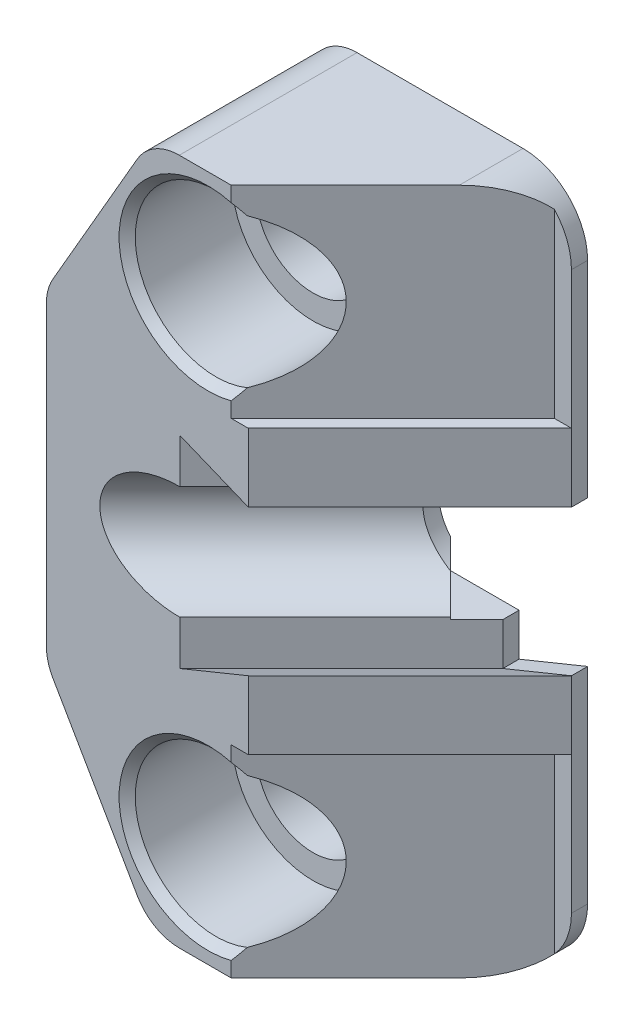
ISO-10303-21;
HEADER;
FILE_DESCRIPTION(('STEP AP214'),'2;1');
FILE_NAME('part.step','',(''),(''),'','','');
FILE_SCHEMA(('AUTOMOTIVE_DESIGN { 1 0 10303 214 1 1 1 1 }'));
ENDSEC;
DATA;
#1=APPLICATION_CONTEXT('core data for automotive mechanical design processes');
#2=APPLICATION_PROTOCOL_DEFINITION('international standard','automotive_design',2000,#1);
#3=PRODUCT_CONTEXT('',#1,'mechanical');
#4=PRODUCT('Part','Part','',(#3));
#5=PRODUCT_RELATED_PRODUCT_CATEGORY('part','',(#4));
#6=PRODUCT_DEFINITION_FORMATION('','',#4);
#7=PRODUCT_DEFINITION_CONTEXT('part definition',#1,'design');
#8=PRODUCT_DEFINITION('design','',#6,#7);
#9=PRODUCT_DEFINITION_SHAPE('','',#8);
#10=(LENGTH_UNIT() NAMED_UNIT(*) SI_UNIT(.MILLI.,.METRE.));
#11=(NAMED_UNIT(*) PLANE_ANGLE_UNIT() SI_UNIT($,.RADIAN.));
#12=(NAMED_UNIT(*) SI_UNIT($,.STERADIAN.) SOLID_ANGLE_UNIT());
#13=UNCERTAINTY_MEASURE_WITH_UNIT(LENGTH_MEASURE(1.E-05),#10,'distance_accuracy_value','');
#14=(GEOMETRIC_REPRESENTATION_CONTEXT(3) GLOBAL_UNCERTAINTY_ASSIGNED_CONTEXT((#13)) GLOBAL_UNIT_ASSIGNED_CONTEXT((#10,
#11,#12)) REPRESENTATION_CONTEXT('',''));
#15=CARTESIAN_POINT('',(0.,0.,0.));
#16=DIRECTION('',(0.,0.,1.));
#17=DIRECTION('',(1.,0.,0.));
#18=AXIS2_PLACEMENT_3D('',#15,#16,#17);
#19=CARTESIAN_POINT('',(24.9999999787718,-12.5000000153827,22.));
#20=DIRECTION('',(6.15310188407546E-10,1.,0.));
#21=DIRECTION('',(6.15310341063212E-10,0.,-1.));
#22=AXIS2_PLACEMENT_3D('',#19,#20,#21);
#23=PLANE('',#22);
#24=DIRECTION('',(-1.,6.15310488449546E-10,-6.1531054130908E-10));
#25=VECTOR('',#24,1.);
#26=CARTESIAN_POINT('',(-7.00961895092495,-12.4999999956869,-1.96958797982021E-08));
#27=LINE('',#26,#25);
#28=CARTESIAN_POINT('',(16.9999999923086,-12.5000000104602,-4.92251410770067E-09));
#29=VERTEX_POINT('',#28);
#30=CARTESIAN_POINT('',(-3.54551733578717,-12.4999999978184,-1.75643825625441E-08));
#31=VERTEX_POINT('',#30);
#32=EDGE_CURVE('E342',#29,#31,#27,.T.);
#33=ORIENTED_EDGE('',*,*,#32,.F.);
#34=DIRECTION('',(-6.15310591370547E-10,0.,1.));
#35=VECTOR('',#34,1.);
#36=CARTESIAN_POINT('',(16.9999999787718,-12.5000000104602,21.9999999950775));
#37=LINE('',#36,#35);
#38=CARTESIAN_POINT('',(16.9999999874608,-12.5000000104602,7.87867965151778));
#39=VERTEX_POINT('',#38);
#40=EDGE_CURVE('E750',#29,#39,#37,.T.);
#41=ORIENTED_EDGE('',*,*,#40,.T.);
#42=DIRECTION('',(-0.707106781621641,4.35089967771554E-10,0.707106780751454));
#43=VECTOR('',#42,1.);
#44=CARTESIAN_POINT('',(22.8786796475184,-12.5000000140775,1.9999999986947));
#45=LINE('',#44,#43);
#46=CARTESIAN_POINT('',(2.87867963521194,-12.5000000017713,21.9999999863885));
#47=VERTEX_POINT('',#46);
#48=EDGE_CURVE('E282',#39,#47,#45,.T.);
#49=ORIENTED_EDGE('',*,*,#48,.T.);
#50=DIRECTION('',(1.,-6.15310271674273E-10,6.15310291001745E-10));
#51=VECTOR('',#50,1.);
#52=CARTESIAN_POINT('',(24.9999999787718,-12.5000000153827,22.));
#53=LINE('',#52,#51);
#54=CARTESIAN_POINT('',(-3.545517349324,-12.4999999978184,21.9999999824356));
#55=VERTEX_POINT('',#54);
#56=EDGE_CURVE('E667',#55,#47,#53,.T.);
#57=ORIENTED_EDGE('',*,*,#56,.F.);
#58=DIRECTION('',(-6.15310341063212E-10,0.,1.));
#59=VECTOR('',#58,1.);
#60=CARTESIAN_POINT('',(-3.545517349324,-12.4999999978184,21.9999999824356));
#61=LINE('',#60,#59);
#62=EDGE_CURVE('E701',#55,#31,#61,.F.);
#63=ORIENTED_EDGE('',*,*,#62,.T.);
#64=EDGE_LOOP('',(#33,#41,#49,#57,#63));
#65=FACE_BOUND('',#64,.T.);
#66=ADVANCED_FACE('F14',(#65),#23,.F.);
#67=CARTESIAN_POINT('',(25.0000000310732,72.4999999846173,22.));
#68=DIRECTION('',(-6.15310341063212E-10,0.,1.));
#69=DIRECTION('',(-1.,6.15310271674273E-10,-6.15310291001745E-10));
#70=AXIS2_PLACEMENT_3D('',#67,#68,#69);
#71=PLANE('',#70);
#72=ORIENTED_EDGE('',*,*,#56,.T.);
#73=DIRECTION('',(-6.15310188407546E-10,-1.,0.));
#74=VECTOR('',#73,1.);
#75=CARTESIAN_POINT('',(2.8786796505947,12.4999999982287,21.9999999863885));
#76=LINE('',#75,#74);
#77=CARTESIAN_POINT('',(2.87867963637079,-10.6166474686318,21.9999999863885));
#78=VERTEX_POINT('',#77);
#79=EDGE_CURVE('E295',#78,#47,#76,.T.);
#80=ORIENTED_EDGE('',*,*,#79,.F.);
#81=CARTESIAN_POINT('',(-1.35368279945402E-08,0.,21.9999999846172));
#82=DIRECTION('',(-6.15310341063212E-10,0.,1.));
#83=DIRECTION('',(-1.,6.15310271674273E-10,-6.15310291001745E-10));
#84=AXIS2_PLACEMENT_3D('',#81,#82,#83);
#85=CIRCLE('',#84,11.);
#86=CARTESIAN_POINT('',(2.87867964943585,10.6166474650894,21.9999999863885));
#87=VERTEX_POINT('',#86);
#88=EDGE_CURVE('E682',#78,#87,#85,.F.);
#89=ORIENTED_EDGE('',*,*,#88,.T.);
#90=CARTESIAN_POINT('',(2.8786796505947,12.4999999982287,21.9999999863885));
#91=VERTEX_POINT('',#90);
#92=EDGE_CURVE('E300',#91,#87,#76,.T.);
#93=ORIENTED_EDGE('',*,*,#92,.F.);
#94=DIRECTION('',(1.,-6.15310271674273E-10,6.15315197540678E-10));
#95=VECTOR('',#94,1.);
#96=CARTESIAN_POINT('',(4.99999999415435,12.4999999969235,21.9999999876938));
#97=LINE('',#96,#95);
#98=CARTESIAN_POINT('',(4.99999999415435,12.4999999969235,21.9999999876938));
#99=VERTEX_POINT('',#98);
#100=EDGE_CURVE('E290',#91,#99,#97,.T.);
#101=ORIENTED_EDGE('',*,*,#100,.T.);
#102=DIRECTION('',(6.15310188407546E-10,1.,0.));
#103=VECTOR('',#102,1.);
#104=CARTESIAN_POINT('',(4.99999997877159,-12.5000000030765,21.9999999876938));
#105=LINE('',#104,#103);
#106=CARTESIAN_POINT('',(4.99999999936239,20.9641016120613,21.9999999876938));
#107=VERTEX_POINT('',#106);
#108=EDGE_CURVE('E659',#99,#107,#105,.T.);
#109=ORIENTED_EDGE('',*,*,#108,.T.);
#110=DIRECTION('',(0.925820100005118,0.377964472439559,5.69666699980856E-10));
#111=VECTOR('',#110,1.);
#112=CARTESIAN_POINT('',(40.1766649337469,35.3249149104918,22.0000000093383));
#113=LINE('',#112,#111);
#114=CARTESIAN_POINT('',(-3.48528137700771,17.5000000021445,21.9999999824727));
#115=VERTEX_POINT('',#114);
#116=EDGE_CURVE('E597',#115,#107,#113,.T.);
#117=ORIENTED_EDGE('',*,*,#116,.F.);
#118=DIRECTION('',(-6.15309557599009E-10,-1.,0.));
#119=VECTOR('',#118,1.);
#120=CARTESIAN_POINT('',(-3.48528134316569,72.5000000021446,21.9999999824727));
#121=LINE('',#120,#119);
#122=CARTESIAN_POINT('',(-3.4852813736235,23.0000000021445,21.9999999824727));
#123=VERTEX_POINT('',#122);
#124=EDGE_CURVE('E644',#123,#115,#121,.T.);
#125=ORIENTED_EDGE('',*,*,#124,.F.);
#126=CARTESIAN_POINT('',(-3.48528136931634,30.0000000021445,21.9999999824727));
#127=DIRECTION('',(-6.15310341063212E-10,0.,1.));
#128=DIRECTION('',(-1.,6.1530963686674E-10,-6.15310291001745E-10));
#129=AXIS2_PLACEMENT_3D('',#126,#127,#128);
#130=ELLIPSE('',#129,9.89949493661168,7.);
#131=CARTESIAN_POINT('',(-3.48528136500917,37.0000000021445,21.9999999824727));
#132=VERTEX_POINT('',#131);
#133=EDGE_CURVE('E641',#132,#123,#130,.T.);
#134=ORIENTED_EDGE('',*,*,#133,.F.);
#135=DIRECTION('',(-6.15309557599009E-10,-1.,0.));
#136=VECTOR('',#135,1.);
#137=CARTESIAN_POINT('',(-3.4852813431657,72.5000000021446,21.9999999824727));
#138=LINE('',#137,#136);
#139=CARTESIAN_POINT('',(-3.48528136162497,42.5000000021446,21.9999999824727));
#140=VERTEX_POINT('',#139);
#141=EDGE_CURVE('E638',#140,#132,#138,.T.);
#142=ORIENTED_EDGE('',*,*,#141,.F.);
#143=DIRECTION('',(-0.925820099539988,0.377964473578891,-5.69666570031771E-10));
#144=VECTOR('',#143,1.);
#145=CARTESIAN_POINT('',(10.4328609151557,36.8179422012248,21.9999999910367));
#146=LINE('',#145,#144);
#147=CARTESIAN_POINT('',(5.00000001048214,39.0358983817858,21.9999999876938));
#148=VERTEX_POINT('',#147);
#149=EDGE_CURVE('E596',#148,#140,#146,.T.);
#150=ORIENTED_EDGE('',*,*,#149,.F.);
#151=CARTESIAN_POINT('',(5.0000000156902,47.4999999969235,21.9999999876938));
#152=VERTEX_POINT('',#151);
#153=EDGE_CURVE('E658',#148,#152,#105,.T.);
#154=ORIENTED_EDGE('',*,*,#153,.T.);
#155=DIRECTION('',(1.,-6.15310271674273E-10,6.15315197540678E-10));
#156=VECTOR('',#155,1.);
#157=CARTESIAN_POINT('',(5.0000000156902,47.4999999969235,21.9999999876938));
#158=LINE('',#157,#156);
#159=CARTESIAN_POINT('',(2.87867967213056,47.4999999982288,21.9999999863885));
#160=VERTEX_POINT('',#159);
#161=EDGE_CURVE('E311',#160,#152,#158,.T.);
#162=ORIENTED_EDGE('',*,*,#161,.F.);
#163=DIRECTION('',(6.15310188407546E-10,1.,0.));
#164=VECTOR('',#163,1.);
#165=CARTESIAN_POINT('',(2.87867967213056,47.4999999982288,21.9999999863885));
#166=LINE('',#165,#164);
#167=CARTESIAN_POINT('',(2.87867967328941,49.3833525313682,21.9999999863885));
#168=VERTEX_POINT('',#167);
#169=EDGE_CURVE('E321',#160,#168,#166,.T.);
#170=ORIENTED_EDGE('',*,*,#169,.T.);
#171=CARTESIAN_POINT('',(2.33817759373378E-08,60.,21.9999999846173));
#172=DIRECTION('',(-6.15310341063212E-10,0.,1.));
#173=DIRECTION('',(-1.,6.15310271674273E-10,-6.15310291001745E-10));
#174=AXIS2_PLACEMENT_3D('',#171,#172,#173);
#175=CIRCLE('',#174,11.);
#176=CARTESIAN_POINT('',(2.87867968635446,70.6166474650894,21.9999999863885));
#177=VERTEX_POINT('',#176);
#178=EDGE_CURVE('E679',#168,#177,#175,.F.);
#179=ORIENTED_EDGE('',*,*,#178,.T.);
#180=CARTESIAN_POINT('',(2.87867968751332,72.4999999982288,21.9999999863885));
#181=VERTEX_POINT('',#180);
#182=EDGE_CURVE('E324',#177,#181,#166,.T.);
#183=ORIENTED_EDGE('',*,*,#182,.T.);
#184=DIRECTION('',(-1.,6.15310271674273E-10,-6.15310291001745E-10));
#185=VECTOR('',#184,1.);
#186=CARTESIAN_POINT('',(25.0000000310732,72.4999999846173,22.));
#187=LINE('',#186,#185);
#188=CARTESIAN_POINT('',(-3.54551729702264,72.5000000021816,21.9999999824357));
#189=VERTEX_POINT('',#188);
#190=EDGE_CURVE('E664',#181,#189,#187,.T.);
#191=ORIENTED_EDGE('',*,*,#190,.T.);
#192=CARTESIAN_POINT('',(-3.54551730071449,66.5000000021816,21.9999999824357));
#193=DIRECTION('',(-6.15310341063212E-10,0.,1.));
#194=DIRECTION('',(-1.,6.15310271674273E-10,-6.15310291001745E-10));
#195=AXIS2_PLACEMENT_3D('',#192,#193,#194);
#196=CIRCLE('',#195,6.);
#197=CARTESIAN_POINT('',(-8.74166972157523,69.5000000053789,21.9999999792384));
#198=VERTEX_POINT('',#197);
#199=EDGE_CURVE('E693',#189,#198,#196,.T.);
#200=ORIENTED_EDGE('',*,*,#199,.T.);
#201=DIRECTION('',(0.500000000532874,0.866025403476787,3.07655294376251E-10));
#202=VECTOR('',#201,1.);
#203=CARTESIAN_POINT('',(-19.9999999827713,50.0000000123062,21.999999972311));
#204=LINE('',#203,#202);
#205=CARTESIAN_POINT('',(-19.1961524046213,51.3923048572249,21.9999999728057));
#206=VERTEX_POINT('',#205);
#207=EDGE_CURVE('E608',#206,#198,#204,.T.);
#208=ORIENTED_EDGE('',*,*,#207,.F.);
#209=CARTESIAN_POINT('',(-13.9999999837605,48.3923048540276,21.9999999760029));
#210=DIRECTION('',(-6.15310341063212E-10,0.,1.));
#211=DIRECTION('',(-1.,6.15310271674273E-10,-6.15310291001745E-10));
#212=AXIS2_PLACEMENT_3D('',#209,#210,#211);
#213=CIRCLE('',#212,6.);
#214=CARTESIAN_POINT('',(-19.9999999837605,48.3923048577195,21.999999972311));
#215=VERTEX_POINT('',#214);
#216=EDGE_CURVE('E695',#206,#215,#213,.T.);
#217=ORIENTED_EDGE('',*,*,#216,.T.);
#218=DIRECTION('',(6.15310065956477E-10,1.,0.));
#219=VECTOR('',#218,1.);
#220=CARTESIAN_POINT('',(-20.0000000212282,-12.4999999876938,21.999999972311));
#221=LINE('',#220,#219);
#222=CARTESIAN_POINT('',(-20.0000000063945,11.607695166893,21.999999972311));
#223=VERTEX_POINT('',#222);
#224=EDGE_CURVE('E614',#223,#215,#221,.T.);
#225=ORIENTED_EDGE('',*,*,#224,.F.);
#226=CARTESIAN_POINT('',(-14.0000000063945,11.6076951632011,21.9999999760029));
#227=DIRECTION('',(-6.15310341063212E-10,0.,1.));
#228=DIRECTION('',(-1.,6.15310271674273E-10,-6.15310291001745E-10));
#229=AXIS2_PLACEMENT_3D('',#226,#227,#228);
#230=CIRCLE('',#229,6.);
#231=CARTESIAN_POINT('',(-19.1961524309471,8.60769516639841,21.9999999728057));
#232=VERTEX_POINT('',#231);
#233=EDGE_CURVE('E697',#223,#232,#230,.T.);
#234=ORIENTED_EDGE('',*,*,#233,.T.);
#235=DIRECTION('',(-0.499999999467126,0.866025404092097,-3.07654996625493E-10));
#236=VECTOR('',#235,1.);
#237=CARTESIAN_POINT('',(-20.0000000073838,10.0000000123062,21.999999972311));
#238=LINE('',#237,#236);
#239=CARTESIAN_POINT('',(-8.74166977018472,-9.4999999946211,21.9999999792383));
#240=VERTEX_POINT('',#239);
#241=EDGE_CURVE('E611',#240,#232,#238,.T.);
#242=ORIENTED_EDGE('',*,*,#241,.F.);
#243=CARTESIAN_POINT('',(-3.54551734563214,-6.49999999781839,21.9999999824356));
#244=DIRECTION('',(-6.15310341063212E-10,0.,1.));
#245=DIRECTION('',(-1.,6.15310271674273E-10,-6.15310291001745E-10));
#246=AXIS2_PLACEMENT_3D('',#243,#244,#245);
#247=CIRCLE('',#246,6.);
#248=EDGE_CURVE('E699',#240,#55,#247,.T.);
#249=ORIENTED_EDGE('',*,*,#248,.T.);
#250=EDGE_LOOP('',(#72,#80,#89,#93,#101,#109,#117,#125,#134,#142,#150,#154,#162,#170,#179,#183,
#191,#200,#208,#217,#225,#234,#242,#249));
#251=FACE_BOUND('',#250,.T.);
#252=ADVANCED_FACE('F494',(#251),#71,.T.);
#253=CARTESIAN_POINT('',(24.999999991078,-12.5000000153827,1.99999999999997));
#254=DIRECTION('',(-0.707106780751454,4.35090163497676E-10,-0.707106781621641));
#255=DIRECTION('',(0.707106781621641,-4.35089967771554E-10,-0.707106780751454));
#256=AXIS2_PLACEMENT_3D('',#253,#254,#255);
#257=PLANE('',#256);
#258=DIRECTION('',(0.707106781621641,-4.35089967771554E-10,-0.707106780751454));
#259=VECTOR('',#258,1.);
#260=CARTESIAN_POINT('',(25.0000000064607,12.4999999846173,1.99999999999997));
#261=LINE('',#260,#259);
#262=CARTESIAN_POINT('',(25.0000000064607,12.4999999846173,1.99999999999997));
#263=VERTEX_POINT('',#262);
#264=EDGE_CURVE('E287',#99,#263,#261,.T.);
#265=ORIENTED_EDGE('',*,*,#264,.T.);
#266=DIRECTION('',(6.15310065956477E-10,1.,0.));
#267=VECTOR('',#266,1.);
#268=CARTESIAN_POINT('',(24.999999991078,-12.5000000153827,1.99999999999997));
#269=LINE('',#268,#267);
#270=CARTESIAN_POINT('',(25.0000000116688,20.9641015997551,1.99999999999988));
#271=VERTEX_POINT('',#270);
#272=EDGE_CURVE('E665',#263,#271,#269,.T.);
#273=ORIENTED_EDGE('',*,*,#272,.T.);
#274=DIRECTION('',(-0.707106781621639,4.35089518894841E-10,0.707106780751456));
#275=VECTOR('',#274,1.);
#276=CARTESIAN_POINT('',(25.0000000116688,20.9641015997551,1.99999999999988));
#277=LINE('',#276,#275);
#278=EDGE_CURVE('E621',#271,#107,#277,.T.);
#279=ORIENTED_EDGE('',*,*,#278,.T.);
#280=ORIENTED_EDGE('',*,*,#108,.F.);
#281=EDGE_LOOP('',(#265,#273,#279,#280));
#282=FACE_BOUND('',#281,.T.);
#283=ADVANCED_FACE('F500',(#282),#257,.F.);
#284=CARTESIAN_POINT('',(-1.35368279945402E-08,0.,21.9999999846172));
#285=DIRECTION('',(-6.15310341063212E-10,0.,1.));
#286=DIRECTION('',(-1.,6.15310271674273E-10,-6.15310291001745E-10));
#287=AXIS2_PLACEMENT_3D('',#284,#285,#286);
#288=CYLINDRICAL_SURFACE('',#287,10.);
#289=CARTESIAN_POINT('',(-5.53779356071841E-09,0.,8.99999998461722));
#290=DIRECTION('',(-6.15310341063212E-10,0.,1.));
#291=DIRECTION('',(-1.,6.15310271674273E-10,-6.15310291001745E-10));
#292=AXIS2_PLACEMENT_3D('',#289,#290,#291);
#293=CIRCLE('',#292,10.);
#294=CARTESIAN_POINT('',(-10.0000000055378,6.15310271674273E-09,8.99999997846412));
#295=VERTEX_POINT('',#294);
#296=EDGE_CURVE('E649',#295,#295,#293,.T.);
#297=ORIENTED_EDGE('',*,*,#296,.F.);
#298=EDGE_LOOP('',(#297));
#299=FACE_BOUND('',#298,.T.);
#300=CARTESIAN_POINT('',(-1.5308109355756E-08,0.,24.8786796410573));
#301=DIRECTION('',(0.707106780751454,-4.35090163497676E-10,0.707106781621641));
#302=DIRECTION('',(-0.707106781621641,4.35089967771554E-10,0.707106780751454));
#303=AXIS2_PLACEMENT_3D('',#300,#301,#302);
#304=ELLIPSE('',#303,14.1421356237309,10.);
#305=CARTESIAN_POINT('',(3.87867964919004,9.2171494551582,20.9999999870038));
#306=VERTEX_POINT('',#305);
#307=CARTESIAN_POINT('',(3.87867963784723,-9.2171494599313,20.9999999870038));
#308=VERTEX_POINT('',#307);
#309=EDGE_CURVE('E299',#306,#308,#304,.F.);
#310=ORIENTED_EDGE('',*,*,#309,.F.);
#311=CARTESIAN_POINT('',(-1.2921517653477E-08,0.,20.9999999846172));
#312=DIRECTION('',(-6.15310341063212E-10,0.,1.));
#313=DIRECTION('',(-1.,6.15310271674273E-10,-6.15310291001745E-10));
#314=AXIS2_PLACEMENT_3D('',#311,#312,#313);
#315=CIRCLE('',#314,10.);
#316=EDGE_CURVE('E676',#306,#308,#315,.T.);
#317=ORIENTED_EDGE('',*,*,#316,.T.);
#318=EDGE_LOOP('',(#310,#317));
#319=FACE_BOUND('',#318,.T.);
#320=ADVANCED_FACE('F440',(#299,#319),#288,.F.);
#321=CARTESIAN_POINT('',(-1.2921517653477E-08,0.,20.9999999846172));
#322=DIRECTION('',(-6.15310341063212E-10,0.,1.));
#323=DIRECTION('',(-1.,6.15310271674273E-10,-6.15310291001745E-10));
#324=AXIS2_PLACEMENT_3D('',#321,#322,#323);
#325=CONICAL_SURFACE('',#324,10.,0.78539816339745);
#326=ORIENTED_EDGE('',*,*,#316,.F.);
#327=CARTESIAN_POINT('',(3.87887964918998,9.2168483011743,20.999799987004));
#328=CARTESIAN_POINT('',(3.79855339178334,9.33780039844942,21.0801262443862));
#329=CARTESIAN_POINT('',(3.71739056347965,9.45763681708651,21.1612890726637));
#330=CARTESIAN_POINT('',(3.55352806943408,9.69511737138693,21.3251515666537));
#331=CARTESIAN_POINT('',(3.47082888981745,9.8127621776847,21.407850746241));
#332=CARTESIAN_POINT('',(3.30398303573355,10.0459693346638,21.5746966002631));
#333=CARTESIAN_POINT('',(3.2198364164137,10.1615317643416,21.6588432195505));
#334=CARTESIAN_POINT('',(3.0501629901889,10.3906881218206,21.8285166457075));
#335=CARTESIAN_POINT('',(2.96463576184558,10.5042814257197,21.9140438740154));
#336=CARTESIAN_POINT('',(2.87847964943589,10.6169089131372,22.0001999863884));
#337=B_SPLINE_CURVE_WITH_KNOTS('',3,(#327,#328,#329,#330,#331,#332,#333,#334,#335,#336),
.UNSPECIFIED.,.F.,.F.,(4,2,2,2,4),(0.,0.497788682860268,0.995422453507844,1.49303730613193,
1.99080704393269),.UNSPECIFIED.);
#338=EDGE_CURVE('E426',#306,#87,#337,.T.);
#339=ORIENTED_EDGE('',*,*,#338,.T.);
#340=ORIENTED_EDGE('',*,*,#88,.F.);
#341=CARTESIAN_POINT('',(2.87847963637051,-10.6169089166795,22.0001999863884));
#342=CARTESIAN_POINT('',(2.96463574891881,-10.504281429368,21.9140438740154));
#343=CARTESIAN_POINT('',(3.05016297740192,-10.3906881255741,21.8285166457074));
#344=CARTESIAN_POINT('',(3.21983640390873,-10.161531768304,21.6588432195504));
#345=CARTESIAN_POINT('',(3.30398302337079,-10.0459693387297,21.574696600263));
#346=CARTESIAN_POINT('',(3.47082887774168,-9.81276218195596,21.407850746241));
#347=CARTESIAN_POINT('',(3.55352805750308,-9.69511737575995,21.3251515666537));
#348=CARTESIAN_POINT('',(3.7173905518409,-9.45763682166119,21.1612890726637));
#349=CARTESIAN_POINT('',(3.79855338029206,-9.33780040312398,21.0801262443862));
#350=CARTESIAN_POINT('',(3.87887963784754,-9.2168483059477,20.999799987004));
#351=B_SPLINE_CURVE_WITH_KNOTS('',3,(#341,#342,#343,#344,#345,#346,#347,#348,#349,#350),
.UNSPECIFIED.,.F.,.F.,(4,2,2,2,4),(0.,0.497769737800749,0.995384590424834,1.49301836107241,
1.99080704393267),.UNSPECIFIED.);
#352=EDGE_CURVE('E419',#78,#308,#351,.T.);
#353=ORIENTED_EDGE('',*,*,#352,.T.);
#354=EDGE_LOOP('',(#326,#339,#340,#353));
#355=FACE_BOUND('',#354,.T.);
#356=ADVANCED_FACE('F435',(#355),#325,.F.);
#357=DIRECTION('',(0.707106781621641,-4.35089967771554E-10,-0.707106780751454));
#358=VECTOR('',#357,1.);
#359=CARTESIAN_POINT('',(25.0000000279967,47.4999999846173,2.));
#360=LINE('',#359,#358);
#361=CARTESIAN_POINT('',(25.0000000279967,47.4999999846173,2.));
#362=VERTEX_POINT('',#361);
#363=EDGE_CURVE('E313',#152,#362,#360,.T.);
#364=ORIENTED_EDGE('',*,*,#363,.F.);
#365=ORIENTED_EDGE('',*,*,#153,.F.);
#366=DIRECTION('',(-0.707106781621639,4.35089518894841E-10,0.707106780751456));
#367=VECTOR('',#366,1.);
#368=CARTESIAN_POINT('',(25.0000000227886,39.0358983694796,1.99999999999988));
#369=LINE('',#368,#367);
#370=CARTESIAN_POINT('',(25.0000000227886,39.0358983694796,1.99999999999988));
#371=VERTEX_POINT('',#370);
#372=EDGE_CURVE('E618',#371,#148,#369,.T.);
#373=ORIENTED_EDGE('',*,*,#372,.F.);
#374=EDGE_CURVE('E661',#371,#362,#269,.T.);
#375=ORIENTED_EDGE('',*,*,#374,.T.);
#376=EDGE_LOOP('',(#364,#365,#373,#375));
#377=FACE_BOUND('',#376,.T.);
#378=ADVANCED_FACE('F439',(#377),#257,.F.);
#379=CARTESIAN_POINT('',(25.0000000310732,72.4999999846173,22.));
#380=DIRECTION('',(-6.15310188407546E-10,-1.,0.));
#381=DIRECTION('',(-6.15310341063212E-10,0.,1.));
#382=AXIS2_PLACEMENT_3D('',#379,#380,#381);
#383=PLANE('',#382);
#384=DIRECTION('',(-0.707106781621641,4.35089967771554E-10,0.707106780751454));
#385=VECTOR('',#384,1.);
#386=CARTESIAN_POINT('',(22.8786796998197,72.4999999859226,1.99999999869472));
#387=LINE('',#386,#385);
#388=CARTESIAN_POINT('',(17.0000000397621,72.4999999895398,7.8786796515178));
#389=VERTEX_POINT('',#388);
#390=EDGE_CURVE('E303',#389,#181,#387,.T.);
#391=ORIENTED_EDGE('',*,*,#390,.F.);
#392=DIRECTION('',(-6.15310591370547E-10,0.,1.));
#393=VECTOR('',#392,1.);
#394=CARTESIAN_POINT('',(17.0000000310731,72.4999999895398,21.9999999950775));
#395=LINE('',#394,#393);
#396=CARTESIAN_POINT('',(17.00000004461,72.4999999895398,-4.92249936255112E-09));
#397=VERTEX_POINT('',#396);
#398=EDGE_CURVE('E776',#389,#397,#395,.F.);
#399=ORIENTED_EDGE('',*,*,#398,.T.);
#400=DIRECTION('',(1.,-6.15310488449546E-10,6.1531054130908E-10));
#401=VECTOR('',#400,1.);
#402=CARTESIAN_POINT('',(25.00000004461,72.4999999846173,0.));
#403=LINE('',#402,#401);
#404=CARTESIAN_POINT('',(-3.5455172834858,72.5000000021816,-1.75643678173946E-08));
#405=VERTEX_POINT('',#404);
#406=EDGE_CURVE('E353',#405,#397,#403,.T.);
#407=ORIENTED_EDGE('',*,*,#406,.F.);
#408=DIRECTION('',(-6.15310341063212E-10,0.,1.));
#409=VECTOR('',#408,1.);
#410=CARTESIAN_POINT('',(-3.54551729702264,72.5000000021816,21.9999999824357));
#411=LINE('',#410,#409);
#412=EDGE_CURVE('E463',#405,#189,#411,.T.);
#413=ORIENTED_EDGE('',*,*,#412,.T.);
#414=ORIENTED_EDGE('',*,*,#190,.F.);
#415=EDGE_LOOP('',(#391,#399,#407,#413,#414));
#416=FACE_BOUND('',#415,.T.);
#417=ADVANCED_FACE('F16',(#416),#383,.F.);
#418=CARTESIAN_POINT('',(2.33817759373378E-08,60.,21.9999999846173));
#419=DIRECTION('',(-6.15310341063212E-10,0.,1.));
#420=DIRECTION('',(-1.,6.15310271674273E-10,-6.15310291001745E-10));
#421=AXIS2_PLACEMENT_3D('',#418,#419,#420);
#422=CYLINDRICAL_SURFACE('',#421,10.);
#423=CARTESIAN_POINT('',(3.13808103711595E-08,60.,8.99999998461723));
#424=DIRECTION('',(-6.15310341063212E-10,0.,1.));
#425=DIRECTION('',(-1.,6.15310271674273E-10,-6.15310291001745E-10));
#426=AXIS2_PLACEMENT_3D('',#423,#424,#425);
#427=CIRCLE('',#426,10.);
#428=CARTESIAN_POINT('',(-9.99999996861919,60.0000000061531,8.99999997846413));
#429=VERTEX_POINT('',#428);
#430=EDGE_CURVE('E655',#429,#429,#427,.T.);
#431=ORIENTED_EDGE('',*,*,#430,.F.);
#432=EDGE_LOOP('',(#431));
#433=FACE_BOUND('',#432,.T.);
#434=CARTESIAN_POINT('',(2.3997086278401E-08,60.,20.9999999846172));
#435=DIRECTION('',(-6.15310341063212E-10,0.,1.));
#436=DIRECTION('',(-1.,6.15310271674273E-10,-6.15310291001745E-10));
#437=AXIS2_PLACEMENT_3D('',#434,#435,#436);
#438=CIRCLE('',#437,10.);
#439=CARTESIAN_POINT('',(3.87867968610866,69.2171494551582,20.9999999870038));
#440=VERTEX_POINT('',#439);
#441=CARTESIAN_POINT('',(3.87867967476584,50.7828505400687,20.9999999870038));
#442=VERTEX_POINT('',#441);
#443=EDGE_CURVE('E685',#440,#442,#438,.T.);
#444=ORIENTED_EDGE('',*,*,#443,.T.);
#445=CARTESIAN_POINT('',(2.16104945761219E-08,60.,24.8786796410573));
#446=DIRECTION('',(-0.707106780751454,4.35090163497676E-10,-0.707106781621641));
#447=DIRECTION('',(-0.707106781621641,4.35089967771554E-10,0.707106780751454));
#448=AXIS2_PLACEMENT_3D('',#445,#446,#447);
#449=ELLIPSE('',#448,14.1421356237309,10.);
#450=EDGE_CURVE('E320',#442,#440,#449,.F.);
#451=ORIENTED_EDGE('',*,*,#450,.T.);
#452=EDGE_LOOP('',(#444,#451));
#453=FACE_BOUND('',#452,.T.);
#454=ADVANCED_FACE('F508',(#433,#453),#422,.F.);
#455=CARTESIAN_POINT('',(-6.99999996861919,60.0000000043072,8.99999998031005));
#456=DIRECTION('',(6.15310341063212E-10,0.,-1.));
#457=DIRECTION('',(1.,-6.15310271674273E-10,6.15310291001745E-10));
#458=AXIS2_PLACEMENT_3D('',#455,#456,#457);
#459=PLANE('',#458);
#460=CARTESIAN_POINT('',(3.13808103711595E-08,60.,8.99999998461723));
#461=DIRECTION('',(-6.15310341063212E-10,0.,1.));
#462=DIRECTION('',(-1.,6.15310271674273E-10,-6.15310291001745E-10));
#463=AXIS2_PLACEMENT_3D('',#460,#461,#462);
#464=CIRCLE('',#463,7.);
#465=CARTESIAN_POINT('',(-6.99999996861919,60.0000000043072,8.99999998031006));
#466=VERTEX_POINT('',#465);
#467=EDGE_CURVE('E652',#466,#466,#464,.T.);
#468=ORIENTED_EDGE('',*,*,#467,.F.);
#469=EDGE_LOOP('',(#468));
#470=FACE_BOUND('',#469,.T.);
#471=ORIENTED_EDGE('',*,*,#430,.T.);
#472=EDGE_LOOP('',(#471));
#473=FACE_BOUND('',#472,.T.);
#474=ADVANCED_FACE('F511',(#470,#473),#459,.F.);
#475=CARTESIAN_POINT('',(2.33817759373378E-08,60.,21.9999999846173));
#476=DIRECTION('',(-6.15310341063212E-10,0.,1.));
#477=DIRECTION('',(-1.,6.15310271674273E-10,-6.15310291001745E-10));
#478=AXIS2_PLACEMENT_3D('',#475,#476,#477);
#479=CYLINDRICAL_SURFACE('',#478,7.);
#480=ORIENTED_EDGE('',*,*,#467,.T.);
#481=EDGE_LOOP('',(#480));
#482=FACE_BOUND('',#481,.T.);
#483=CARTESIAN_POINT('',(3.69186039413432E-08,60.,-1.53827765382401E-08));
#484=DIRECTION('',(6.15310591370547E-10,0.,-1.));
#485=DIRECTION('',(1.,-6.15310271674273E-10,6.1531054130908E-10));
#486=AXIS2_PLACEMENT_3D('',#483,#484,#485);
#487=CIRCLE('',#486,7.);
#488=CARTESIAN_POINT('',(7.0000000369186,59.9999999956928,-1.10756027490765E-08));
#489=VERTEX_POINT('',#488);
#490=EDGE_CURVE('E332',#489,#489,#487,.T.);
#491=ORIENTED_EDGE('',*,*,#490,.T.);
#492=EDGE_LOOP('',(#491));
#493=FACE_BOUND('',#492,.T.);
#494=ADVANCED_FACE('F515',(#482,#493),#479,.F.);
#495=CARTESIAN_POINT('',(-7.0000000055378,4.30720042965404E-09,8.99999998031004));
#496=DIRECTION('',(6.15310341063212E-10,0.,-1.));
#497=DIRECTION('',(1.,-6.15310271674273E-10,6.15310291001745E-10));
#498=AXIS2_PLACEMENT_3D('',#495,#496,#497);
#499=PLANE('',#498);
#500=CARTESIAN_POINT('',(-5.53779356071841E-09,0.,8.99999998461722));
#501=DIRECTION('',(-6.15310341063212E-10,0.,1.));
#502=DIRECTION('',(-1.,6.15310271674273E-10,-6.15310291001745E-10));
#503=AXIS2_PLACEMENT_3D('',#500,#501,#502);
#504=CIRCLE('',#503,7.);
#505=CARTESIAN_POINT('',(-7.00000000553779,4.30717190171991E-09,8.99999998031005));
#506=VERTEX_POINT('',#505);
#507=EDGE_CURVE('E646',#506,#506,#504,.T.);
#508=ORIENTED_EDGE('',*,*,#507,.F.);
#509=EDGE_LOOP('',(#508));
#510=FACE_BOUND('',#509,.T.);
#511=ORIENTED_EDGE('',*,*,#296,.T.);
#512=EDGE_LOOP('',(#511));
#513=FACE_BOUND('',#512,.T.);
#514=ADVANCED_FACE('F519',(#510,#513),#499,.F.);
#515=CARTESIAN_POINT('',(-1.35368279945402E-08,0.,21.9999999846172));
#516=DIRECTION('',(-6.15310341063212E-10,0.,1.));
#517=DIRECTION('',(-1.,6.15310271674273E-10,-6.15310291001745E-10));
#518=AXIS2_PLACEMENT_3D('',#515,#516,#517);
#519=CYLINDRICAL_SURFACE('',#518,7.);
#520=ORIENTED_EDGE('',*,*,#507,.T.);
#521=EDGE_LOOP('',(#520));
#522=FACE_BOUND('',#521,.T.);
#523=CARTESIAN_POINT('',(0.,0.,-1.53827869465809E-08));
#524=DIRECTION('',(6.15310591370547E-10,0.,-1.));
#525=DIRECTION('',(1.,-6.15310271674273E-10,6.1531054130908E-10));
#526=AXIS2_PLACEMENT_3D('',#523,#524,#525);
#527=CIRCLE('',#526,7.);
#528=CARTESIAN_POINT('',(7.,-4.30717190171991E-09,-1.10756131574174E-08));
#529=VERTEX_POINT('',#528);
#530=EDGE_CURVE('E329',#529,#529,#527,.T.);
#531=ORIENTED_EDGE('',*,*,#530,.T.);
#532=EDGE_LOOP('',(#531));
#533=FACE_BOUND('',#532,.T.);
#534=ADVANCED_FACE('F526',(#522,#533),#519,.F.);
#535=CARTESIAN_POINT('',(20.7573593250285,17.4999999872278,-2.24264068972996));
#536=DIRECTION('',(-0.707106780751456,4.35089717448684E-10,-0.707106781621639));
#537=DIRECTION('',(0.707106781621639,-4.35089967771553E-10,-0.707106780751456));
#538=AXIS2_PLACEMENT_3D('',#535,#536,#537);
#539=PLANE('',#538);
#540=DIRECTION('',(-0.707106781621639,4.35090169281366E-10,0.707106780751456));
#541=VECTOR('',#540,1.);
#542=CARTESIAN_POINT('',(20.7573593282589,22.7499999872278,-2.24264068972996));
#543=LINE('',#542,#541);
#544=CARTESIAN_POINT('',(16.514718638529,22.7499999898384,1.9999999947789));
#545=VERTEX_POINT('',#544);
#546=CARTESIAN_POINT('',(13.257359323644,22.7499999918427,5.25735930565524));
#547=VERTEX_POINT('',#546);
#548=EDGE_CURVE('E279',#545,#547,#543,.T.);
#549=ORIENTED_EDGE('',*,*,#548,.T.);
#550=DIRECTION('',(6.15309992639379E-10,1.,0.));
#551=VECTOR('',#550,1.);
#552=CARTESIAN_POINT('',(13.2573593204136,17.4999999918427,5.25735930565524));
#553=LINE('',#552,#551);
#554=CARTESIAN_POINT('',(13.2573593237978,22.9999999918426,5.25735930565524));
#555=VERTEX_POINT('',#554);
#556=EDGE_CURVE('E794',#547,#555,#553,.T.);
#557=ORIENTED_EDGE('',*,*,#556,.T.);
#558=DIRECTION('',(-0.707106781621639,4.35089518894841E-10,0.707106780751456));
#559=VECTOR('',#558,1.);
#560=CARTESIAN_POINT('',(20.7573593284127,22.9999999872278,-2.24264068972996));
#561=LINE('',#560,#559);
#562=EDGE_CURVE('E627',#555,#123,#561,.T.);
#563=ORIENTED_EDGE('',*,*,#562,.T.);
#564=ORIENTED_EDGE('',*,*,#124,.T.);
#565=DIRECTION('',(-0.707106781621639,4.35089518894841E-10,0.707106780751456));
#566=VECTOR('',#565,1.);
#567=CARTESIAN_POINT('',(20.7573593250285,17.4999999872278,-2.24264068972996));
#568=LINE('',#567,#566);
#569=CARTESIAN_POINT('',(16.5147186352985,17.4999999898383,1.9999999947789));
#570=VERTEX_POINT('',#569);
#571=EDGE_CURVE('E624',#570,#115,#568,.T.);
#572=ORIENTED_EDGE('',*,*,#571,.F.);
#573=DIRECTION('',(-6.15309557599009E-10,-1.,0.));
#574=VECTOR('',#573,1.);
#575=CARTESIAN_POINT('',(16.5147186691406,72.4999999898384,1.99999999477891));
#576=LINE('',#575,#574);
#577=EDGE_CURVE('E674',#545,#570,#576,.T.);
#578=ORIENTED_EDGE('',*,*,#577,.F.);
#579=EDGE_LOOP('',(#549,#557,#563,#564,#572,#578));
#580=FACE_BOUND('',#579,.T.);
#581=ADVANCED_FACE('F530',(#580),#539,.F.);
#582=CARTESIAN_POINT('',(20.7573593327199,29.9999999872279,-2.24264068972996));
#583=DIRECTION('',(-0.707106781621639,4.35089518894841E-10,0.707106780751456));
#584=DIRECTION('',(-0.707106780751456,4.35090163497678E-10,-0.707106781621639));
#585=AXIS2_PLACEMENT_3D('',#582,#583,#584);
#586=CYLINDRICAL_SURFACE('',#585,7.);
#587=CARTESIAN_POINT('',(16.5147186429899,29.9999999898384,1.9999999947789));
#588=DIRECTION('',(-6.15310341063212E-10,0.,1.));
#589=DIRECTION('',(-1.,6.1530963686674E-10,-6.15310291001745E-10));
#590=AXIS2_PLACEMENT_3D('',#587,#588,#589);
#591=ELLIPSE('',#590,9.89949493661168,7.);
#592=CARTESIAN_POINT('',(10.0000000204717,35.2705996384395,1.99999999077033));
#593=VERTEX_POINT('',#592);
#594=CARTESIAN_POINT('',(10.0000000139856,24.7294003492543,1.99999999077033));
#595=VERTEX_POINT('',#594);
#596=EDGE_CURVE('E671',#593,#595,#591,.T.);
#597=ORIENTED_EDGE('',*,*,#596,.F.);
#598=CARTESIAN_POINT('',(13.257359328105,29.9999999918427,5.25735930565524));
#599=DIRECTION('',(-0.707106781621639,4.3509013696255E-10,0.707106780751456));
#600=DIRECTION('',(-0.707106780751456,4.35090163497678E-10,-0.707106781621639));
#601=AXIS2_PLACEMENT_3D('',#598,#599,#600);
#602=CIRCLE('',#601,7.);
#603=CARTESIAN_POINT('',(13.2573593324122,36.9999999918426,5.25735930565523));
#604=VERTEX_POINT('',#603);
#605=EDGE_CURVE('E37',#593,#604,#602,.F.);
#606=ORIENTED_EDGE('',*,*,#605,.T.);
#607=DIRECTION('',(-0.707106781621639,4.35089518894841E-10,0.707106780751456));
#608=VECTOR('',#607,1.);
#609=CARTESIAN_POINT('',(20.757359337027,36.9999999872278,-2.24264068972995));
#610=LINE('',#609,#608);
#611=EDGE_CURVE('E629',#604,#132,#610,.T.);
#612=ORIENTED_EDGE('',*,*,#611,.T.);
#613=ORIENTED_EDGE('',*,*,#133,.T.);
#614=ORIENTED_EDGE('',*,*,#562,.F.);
#615=EDGE_CURVE('E792',#555,#595,#602,.F.);
#616=ORIENTED_EDGE('',*,*,#615,.T.);
#617=EDGE_LOOP('',(#597,#606,#612,#613,#614,#616));
#618=FACE_BOUND('',#617,.T.);
#619=ADVANCED_FACE('F540',(#618),#586,.F.);
#620=CARTESIAN_POINT('',(20.757359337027,36.9999999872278,-2.24264068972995));
#621=DIRECTION('',(-0.707106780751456,4.35089717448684E-10,-0.707106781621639));
#622=DIRECTION('',(0.707106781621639,-4.35089967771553E-10,-0.707106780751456));
#623=AXIS2_PLACEMENT_3D('',#620,#621,#622);
#624=PLANE('',#623);
#625=ORIENTED_EDGE('',*,*,#611,.F.);
#626=DIRECTION('',(6.15309992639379E-10,1.,0.));
#627=VECTOR('',#626,1.);
#628=CARTESIAN_POINT('',(13.2573593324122,36.9999999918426,5.25735930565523));
#629=LINE('',#628,#627);
#630=CARTESIAN_POINT('',(13.257359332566,37.2499999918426,5.25735930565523));
#631=VERTEX_POINT('',#630);
#632=EDGE_CURVE('E271',#604,#631,#629,.T.);
#633=ORIENTED_EDGE('',*,*,#632,.T.);
#634=DIRECTION('',(0.707106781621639,-4.35090169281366E-10,-0.707106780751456));
#635=VECTOR('',#634,1.);
#636=CARTESIAN_POINT('',(20.7573593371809,37.2499999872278,-2.24264068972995));
#637=LINE('',#636,#635);
#638=CARTESIAN_POINT('',(16.5147186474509,37.2499999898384,1.9999999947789));
#639=VERTEX_POINT('',#638);
#640=EDGE_CURVE('E254',#631,#639,#637,.T.);
#641=ORIENTED_EDGE('',*,*,#640,.T.);
#642=DIRECTION('',(-6.15309557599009E-10,-1.,0.));
#643=VECTOR('',#642,1.);
#644=CARTESIAN_POINT('',(16.5147186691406,72.4999999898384,1.99999999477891));
#645=LINE('',#644,#643);
#646=CARTESIAN_POINT('',(16.5147186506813,42.4999999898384,1.9999999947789));
#647=VERTEX_POINT('',#646);
#648=EDGE_CURVE('E600',#647,#639,#645,.T.);
#649=ORIENTED_EDGE('',*,*,#648,.F.);
#650=DIRECTION('',(-0.707106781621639,4.35089518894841E-10,0.707106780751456));
#651=VECTOR('',#650,1.);
#652=CARTESIAN_POINT('',(20.7573593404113,42.4999999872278,-2.24264068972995));
#653=LINE('',#652,#651);
#654=EDGE_CURVE('E617',#647,#140,#653,.T.);
#655=ORIENTED_EDGE('',*,*,#654,.T.);
#656=ORIENTED_EDGE('',*,*,#141,.T.);
#657=EDGE_LOOP('',(#625,#633,#641,#649,#655,#656));
#658=FACE_BOUND('',#657,.T.);
#659=ADVANCED_FACE('F536',(#658),#624,.F.);
#660=CARTESIAN_POINT('',(20.7573593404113,42.4999999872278,-2.24264068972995));
#661=DIRECTION('',(0.353553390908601,0.866025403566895,0.353553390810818));
#662=DIRECTION('',(8.02232072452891E-10,0.377964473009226,-0.925820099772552));
#663=AXIS2_PLACEMENT_3D('',#660,#661,#662);
#664=PLANE('',#663);
#665=ORIENTED_EDGE('',*,*,#149,.T.);
#666=ORIENTED_EDGE('',*,*,#654,.F.);
#667=DIRECTION('',(-0.925820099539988,0.377964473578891,-5.69666570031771E-10));
#668=VECTOR('',#667,1.);
#669=CARTESIAN_POINT('',(13.290003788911,43.8164843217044,1.9999999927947));
#670=LINE('',#669,#668);
#671=EDGE_CURVE('E589',#371,#647,#670,.T.);
#672=ORIENTED_EDGE('',*,*,#671,.F.);
#673=ORIENTED_EDGE('',*,*,#372,.T.);
#674=EDGE_LOOP('',(#665,#666,#672,#673));
#675=FACE_BOUND('',#674,.T.);
#676=ADVANCED_FACE('F532',(#675),#664,.F.);
#677=CARTESIAN_POINT('',(20.7573593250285,17.4999999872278,-2.24264068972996));
#678=DIRECTION('',(0.353553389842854,-0.866025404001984,0.353553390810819));
#679=DIRECTION('',(-3.3710129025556E-10,0.377964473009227,0.925820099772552));
#680=AXIS2_PLACEMENT_3D('',#677,#678,#679);
#681=PLANE('',#680);
#682=ORIENTED_EDGE('',*,*,#116,.T.);
#683=ORIENTED_EDGE('',*,*,#278,.F.);
#684=DIRECTION('',(0.925820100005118,0.377964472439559,5.69666699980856E-10));
#685=VECTOR('',#684,1.);
#686=CARTESIAN_POINT('',(43.0338077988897,28.3263727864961,2.00000001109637));
#687=LINE('',#686,#685);
#688=EDGE_CURVE('E620',#570,#271,#687,.T.);
#689=ORIENTED_EDGE('',*,*,#688,.F.);
#690=ORIENTED_EDGE('',*,*,#571,.T.);
#691=EDGE_LOOP('',(#682,#683,#689,#690));
#692=FACE_BOUND('',#691,.T.);
#693=ADVANCED_FACE('F535',(#692),#681,.F.);
#694=CARTESIAN_POINT('',(-20.000000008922,-12.4999999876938,1.99999997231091));
#695=DIRECTION('',(1.,-6.15310149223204E-10,6.15310291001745E-10));
#696=DIRECTION('',(6.15310065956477E-10,1.,0.));
#697=AXIS2_PLACEMENT_3D('',#694,#695,#696);
#698=PLANE('',#697);
#699=DIRECTION('',(6.15309754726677E-10,1.,0.));
#700=VECTOR('',#699,1.);
#701=CARTESIAN_POINT('',(-19.9999999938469,10.0000000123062,-2.76889911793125E-08));
#702=LINE('',#701,#700);
#703=CARTESIAN_POINT('',(-19.9999999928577,11.607695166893,-2.76889907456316E-08));
#704=VERTEX_POINT('',#703);
#705=CARTESIAN_POINT('',(-19.9999999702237,48.3923048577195,-2.76889842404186E-08));
#706=VERTEX_POINT('',#705);
#707=EDGE_CURVE('E347',#704,#706,#702,.T.);
#708=ORIENTED_EDGE('',*,*,#707,.F.);
#709=DIRECTION('',(-6.15310341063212E-10,0.,1.));
#710=VECTOR('',#709,1.);
#711=CARTESIAN_POINT('',(-19.9999999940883,11.607695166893,1.99999997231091));
#712=LINE('',#711,#710);
#713=EDGE_CURVE('E714',#704,#223,#712,.T.);
#714=ORIENTED_EDGE('',*,*,#713,.T.);
#715=ORIENTED_EDGE('',*,*,#224,.T.);
#716=DIRECTION('',(-6.15310341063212E-10,0.,1.));
#717=VECTOR('',#716,1.);
#718=CARTESIAN_POINT('',(-19.9999999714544,48.3923048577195,1.99999997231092));
#719=LINE('',#718,#717);
#720=EDGE_CURVE('E712',#215,#706,#719,.F.);
#721=ORIENTED_EDGE('',*,*,#720,.T.);
#722=EDGE_LOOP('',(#708,#714,#715,#721));
#723=FACE_BOUND('',#722,.T.);
#724=ADVANCED_FACE('F550',(#723),#698,.F.);
#725=CARTESIAN_POINT('',(-19.9999999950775,10.0000000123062,1.99999997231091));
#726=DIRECTION('',(0.866025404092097,0.499999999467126,5.32874429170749E-10));
#727=DIRECTION('',(-0.499999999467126,0.866025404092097,-3.07654996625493E-10));
#728=AXIS2_PLACEMENT_3D('',#725,#726,#727);
#729=PLANE('',#728);
#730=DIRECTION('',(-0.499999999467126,0.866025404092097,-3.07655265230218E-10));
#731=VECTOR('',#730,1.);
#732=CARTESIAN_POINT('',(-7.00961895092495,-12.4999999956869,-1.96958797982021E-08));
#733=LINE('',#732,#731);
#734=CARTESIAN_POINT('',(-8.74166975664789,-9.4999999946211,-2.07616279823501E-08));
#735=VERTEX_POINT('',#734);
#736=CARTESIAN_POINT('',(-19.1961524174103,8.60769516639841,-2.71943755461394E-08));
#737=VERTEX_POINT('',#736);
#738=EDGE_CURVE('E344',#735,#737,#733,.T.);
#739=ORIENTED_EDGE('',*,*,#738,.F.);
#740=DIRECTION('',(-6.15310341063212E-10,0.,1.));
#741=VECTOR('',#740,1.);
#742=CARTESIAN_POINT('',(-8.74166975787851,-9.4999999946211,1.99999997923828));
#743=LINE('',#742,#741);
#744=EDGE_CURVE('E690',#735,#240,#743,.T.);
#745=ORIENTED_EDGE('',*,*,#744,.T.);
#746=ORIENTED_EDGE('',*,*,#241,.T.);
#747=DIRECTION('',(-6.15310341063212E-10,0.,1.));
#748=VECTOR('',#747,1.);
#749=CARTESIAN_POINT('',(-19.1961524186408,8.60769516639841,1.99999997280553));
#750=LINE('',#749,#748);
#751=EDGE_CURVE('E688',#232,#737,#750,.F.);
#752=ORIENTED_EDGE('',*,*,#751,.T.);
#753=EDGE_LOOP('',(#739,#745,#746,#752));
#754=FACE_BOUND('',#753,.T.);
#755=ADVANCED_FACE('F554',(#754),#729,.F.);
#756=CARTESIAN_POINT('',(-19.9999999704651,50.0000000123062,1.99999997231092));
#757=DIRECTION('',(0.866025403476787,-0.500000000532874,5.32874257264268E-10));
#758=DIRECTION('',(0.500000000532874,0.866025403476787,3.07655294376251E-10));
#759=AXIS2_PLACEMENT_3D('',#756,#757,#758);
#760=PLANE('',#759);
#761=DIRECTION('',(0.500000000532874,0.866025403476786,3.07655276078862E-10));
#762=VECTOR('',#761,1.);
#763=CARTESIAN_POINT('',(-19.9999999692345,50.0000000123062,-2.76889842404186E-08));
#764=LINE('',#763,#762);
#765=CARTESIAN_POINT('',(-19.1961523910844,51.3923048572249,-2.71943681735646E-08));
#766=VERTEX_POINT('',#765);
#767=CARTESIAN_POINT('',(-8.7416697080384,69.5000000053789,-2.07616141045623E-08));
#768=VERTEX_POINT('',#767);
#769=EDGE_CURVE('E350',#766,#768,#764,.T.);
#770=ORIENTED_EDGE('',*,*,#769,.F.);
#771=DIRECTION('',(-6.15310341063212E-10,0.,1.));
#772=VECTOR('',#771,1.);
#773=CARTESIAN_POINT('',(-19.196152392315,51.3923048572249,1.99999997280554));
#774=LINE('',#773,#772);
#775=EDGE_CURVE('E718',#766,#206,#774,.T.);
#776=ORIENTED_EDGE('',*,*,#775,.T.);
#777=ORIENTED_EDGE('',*,*,#207,.T.);
#778=DIRECTION('',(-6.15310341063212E-10,0.,1.));
#779=VECTOR('',#778,1.);
#780=CARTESIAN_POINT('',(-8.74166970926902,69.5000000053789,1.99999997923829));
#781=LINE('',#780,#779);
#782=EDGE_CURVE('E717',#198,#768,#781,.F.);
#783=ORIENTED_EDGE('',*,*,#782,.T.);
#784=EDGE_LOOP('',(#770,#776,#777,#783));
#785=FACE_BOUND('',#784,.T.);
#786=ADVANCED_FACE('F558',(#785),#760,.F.);
#787=CARTESIAN_POINT('',(16.5147186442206,29.9999999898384,-5.22110555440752E-09));
#788=DIRECTION('',(6.15310591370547E-10,0.,-1.));
#789=DIRECTION('',(1.,-6.15310271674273E-10,6.1531054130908E-10));
#790=AXIS2_PLACEMENT_3D('',#787,#788,#789);
#791=PLANE('',#790);
#792=DIRECTION('',(1.,-6.15310270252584E-10,6.1531054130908E-10));
#793=VECTOR('',#792,1.);
#794=CARTESIAN_POINT('',(16.5147186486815,37.2499999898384,-5.22110425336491E-09));
#795=LINE('',#794,#793);
#796=CARTESIAN_POINT('',(8.0000000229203,37.2499999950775,-1.04602983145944E-08));
#797=VERTEX_POINT('',#796);
#798=CARTESIAN_POINT('',(16.5147186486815,37.2499999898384,-5.22110425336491E-09));
#799=VERTEX_POINT('',#798);
#800=EDGE_CURVE('E251',#797,#799,#795,.T.);
#801=ORIENTED_EDGE('',*,*,#800,.F.);
#802=DIRECTION('',(6.15310188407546E-10,1.,0.));
#803=VECTOR('',#802,1.);
#804=CARTESIAN_POINT('',(8.0000000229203,37.2499999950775,-1.04602983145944E-08));
#805=LINE('',#804,#803);
#806=CARTESIAN_POINT('',(8.00000002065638,33.5706838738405,-1.04602987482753E-08));
#807=VERTEX_POINT('',#806);
#808=EDGE_CURVE('E259',#807,#797,#805,.T.);
#809=ORIENTED_EDGE('',*,*,#808,.F.);
#810=CARTESIAN_POINT('',(16.5147186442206,29.9999999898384,-5.22110555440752E-09));
#811=DIRECTION('',(-6.15310591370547E-10,0.,1.));
#812=DIRECTION('',(-1.,6.1530963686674E-10,-6.1531054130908E-10));
#813=AXIS2_PLACEMENT_3D('',#810,#811,#812);
#814=ELLIPSE('',#813,9.89949493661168,7.);
#815=CARTESIAN_POINT('',(8.00000001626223,26.4293161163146,-1.04603000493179E-08));
#816=VERTEX_POINT('',#815);
#817=EDGE_CURVE('E361',#807,#816,#814,.T.);
#818=ORIENTED_EDGE('',*,*,#817,.T.);
#819=CARTESIAN_POINT('',(8.00000001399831,22.7499999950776,-1.04603004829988E-08));
#820=VERTEX_POINT('',#819);
#821=EDGE_CURVE('E29',#820,#816,#805,.T.);
#822=ORIENTED_EDGE('',*,*,#821,.F.);
#823=DIRECTION('',(-1.,6.15310270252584E-10,-6.1531054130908E-10));
#824=VECTOR('',#823,1.);
#825=CARTESIAN_POINT('',(16.5147186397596,22.7499999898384,-5.22110685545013E-09));
#826=LINE('',#825,#824);
#827=CARTESIAN_POINT('',(16.5147186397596,22.7499999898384,-5.22110685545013E-09));
#828=VERTEX_POINT('',#827);
#829=EDGE_CURVE('E273',#828,#820,#826,.T.);
#830=ORIENTED_EDGE('',*,*,#829,.F.);
#831=DIRECTION('',(-6.15310819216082E-10,-1.,0.));
#832=VECTOR('',#831,1.);
#833=CARTESIAN_POINT('',(16.5147186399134,22.9999999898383,-5.22110642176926E-09));
#834=LINE('',#833,#832);
#835=CARTESIAN_POINT('',(16.5147186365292,17.4999999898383,-5.22110772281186E-09));
#836=VERTEX_POINT('',#835);
#837=EDGE_CURVE('E335',#828,#836,#834,.T.);
#838=ORIENTED_EDGE('',*,*,#837,.T.);
#839=DIRECTION('',(0.925820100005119,0.377964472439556,5.69666869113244E-10));
#840=VECTOR('',#839,1.);
#841=CARTESIAN_POINT('',(16.5147186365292,17.4999999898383,-5.22110772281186E-09));
#842=LINE('',#841,#840);
#843=CARTESIAN_POINT('',(25.0000000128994,20.9641015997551,0.));
#844=VERTEX_POINT('',#843);
#845=EDGE_CURVE('E337',#836,#844,#842,.T.);
#846=ORIENTED_EDGE('',*,*,#845,.T.);
#847=DIRECTION('',(-6.15308322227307E-10,-1.,0.));
#848=VECTOR('',#847,1.);
#849=CARTESIAN_POINT('',(24.9999999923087,-12.5000000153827,0.));
#850=LINE('',#849,#848);
#851=CARTESIAN_POINT('',(24.9999999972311,-4.5000000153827,0.));
#852=VERTEX_POINT('',#851);
#853=EDGE_CURVE('E339',#844,#852,#850,.T.);
#854=ORIENTED_EDGE('',*,*,#853,.T.);
#855=CARTESIAN_POINT('',(16.9999999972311,-4.50000001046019,-4.92251280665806E-09));
#856=DIRECTION('',(6.15310591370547E-10,0.,-1.));
#857=DIRECTION('',(1.,-6.15310271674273E-10,6.1531054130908E-10));
#858=AXIS2_PLACEMENT_3D('',#855,#856,#857);
#859=CIRCLE('',#858,8.);
#860=EDGE_CURVE('E773',#852,#29,#859,.T.);
#861=ORIENTED_EDGE('',*,*,#860,.T.);
#862=ORIENTED_EDGE('',*,*,#32,.T.);
#863=CARTESIAN_POINT('',(-3.5455173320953,-6.49999999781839,-1.75643812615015E-08));
#864=DIRECTION('',(6.15310591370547E-10,0.,-1.));
#865=DIRECTION('',(1.,-6.15310271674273E-10,6.1531054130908E-10));
#866=AXIS2_PLACEMENT_3D('',#863,#864,#865);
#867=CIRCLE('',#866,6.);
#868=EDGE_CURVE('E710',#31,#735,#867,.T.);
#869=ORIENTED_EDGE('',*,*,#868,.T.);
#870=ORIENTED_EDGE('',*,*,#738,.T.);
#871=CARTESIAN_POINT('',(-13.9999999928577,11.6076951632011,-2.39971288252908E-08));
#872=DIRECTION('',(6.15310591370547E-10,0.,-1.));
#873=DIRECTION('',(1.,-6.15310271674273E-10,6.1531054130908E-10));
#874=AXIS2_PLACEMENT_3D('',#871,#872,#873);
#875=CIRCLE('',#874,6.);
#876=EDGE_CURVE('E708',#737,#704,#875,.T.);
#877=ORIENTED_EDGE('',*,*,#876,.T.);
#878=ORIENTED_EDGE('',*,*,#707,.T.);
#879=CARTESIAN_POINT('',(-13.9999999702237,48.3923048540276,-2.39971227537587E-08));
#880=DIRECTION('',(6.15310591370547E-10,0.,-1.));
#881=DIRECTION('',(1.,-6.15310271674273E-10,6.1531054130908E-10));
#882=AXIS2_PLACEMENT_3D('',#879,#880,#881);
#883=CIRCLE('',#882,6.);
#884=EDGE_CURVE('E706',#706,#766,#883,.T.);
#885=ORIENTED_EDGE('',*,*,#884,.T.);
#886=ORIENTED_EDGE('',*,*,#769,.T.);
#887=CARTESIAN_POINT('',(-3.54551728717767,66.5000000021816,-1.75643686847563E-08));
#888=DIRECTION('',(6.15310591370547E-10,0.,-1.));
#889=DIRECTION('',(1.,-6.15310271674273E-10,6.1531054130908E-10));
#890=AXIS2_PLACEMENT_3D('',#887,#888,#889);
#891=CIRCLE('',#890,6.);
#892=EDGE_CURVE('E704',#768,#405,#891,.T.);
#893=ORIENTED_EDGE('',*,*,#892,.T.);
#894=ORIENTED_EDGE('',*,*,#406,.T.);
#895=CARTESIAN_POINT('',(17.0000000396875,64.4999999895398,-4.92250066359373E-09));
#896=DIRECTION('',(6.15310591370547E-10,0.,-1.));
#897=DIRECTION('',(1.,-6.15310271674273E-10,6.1531054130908E-10));
#898=AXIS2_PLACEMENT_3D('',#895,#896,#897);
#899=CIRCLE('',#898,8.);
#900=CARTESIAN_POINT('',(25.0000000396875,64.4999999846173,0.));
#901=VERTEX_POINT('',#900);
#902=EDGE_CURVE('E775',#397,#901,#899,.T.);
#903=ORIENTED_EDGE('',*,*,#902,.T.);
#904=DIRECTION('',(-6.15312158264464E-10,-1.,0.));
#905=VECTOR('',#904,1.);
#906=CARTESIAN_POINT('',(25.0000000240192,39.0358983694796,0.));
#907=LINE('',#906,#905);
#908=CARTESIAN_POINT('',(25.0000000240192,39.0358983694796,0.));
#909=VERTEX_POINT('',#908);
#910=EDGE_CURVE('E356',#901,#909,#907,.T.);
#911=ORIENTED_EDGE('',*,*,#910,.T.);
#912=DIRECTION('',(-0.925820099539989,0.377964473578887,-5.69666864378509E-10));
#913=VECTOR('',#912,1.);
#914=CARTESIAN_POINT('',(25.0000000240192,39.0358983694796,0.));
#915=LINE('',#914,#913);
#916=CARTESIAN_POINT('',(16.5147186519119,42.4999999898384,-5.22110338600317E-09));
#917=VERTEX_POINT('',#916);
#918=EDGE_CURVE('E358',#909,#917,#915,.T.);
#919=ORIENTED_EDGE('',*,*,#918,.T.);
#920=DIRECTION('',(-6.15309557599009E-10,-1.,0.));
#921=VECTOR('',#920,1.);
#922=CARTESIAN_POINT('',(16.5147186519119,42.4999999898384,-5.22110338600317E-09));
#923=LINE('',#922,#921);
#924=EDGE_CURVE('E270',#917,#799,#923,.T.);
#925=ORIENTED_EDGE('',*,*,#924,.T.);
#926=EDGE_LOOP('',(#801,#809,#818,#822,#830,#838,#846,#854,#861,#862,#869,#870,#877,#878,#885,
#886,#893,#894,#903,#911,#919,#925));
#927=FACE_BOUND('',#926,.T.);
#928=ORIENTED_EDGE('',*,*,#490,.F.);
#929=EDGE_LOOP('',(#928));
#930=FACE_BOUND('',#929,.T.);
#931=ORIENTED_EDGE('',*,*,#530,.F.);
#932=EDGE_LOOP('',(#931));
#933=FACE_BOUND('',#932,.T.);
#934=ADVANCED_FACE('F267',(#927,#930,#933),#791,.T.);
#935=CARTESIAN_POINT('',(16.5147186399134,22.9999999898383,-5.22110642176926E-09));
#936=DIRECTION('',(-1.,6.15310902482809E-10,-6.1531054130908E-10));
#937=DIRECTION('',(-6.15310819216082E-10,-1.,0.));
#938=AXIS2_PLACEMENT_3D('',#935,#936,#937);
#939=PLANE('',#938);
#940=ORIENTED_EDGE('',*,*,#837,.F.);
#941=DIRECTION('',(-6.15310591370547E-10,0.,1.));
#942=VECTOR('',#941,1.);
#943=CARTESIAN_POINT('',(16.5147186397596,22.7499999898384,-5.22110685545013E-09));
#944=LINE('',#943,#942);
#945=EDGE_CURVE('E9',#828,#545,#944,.T.);
#946=ORIENTED_EDGE('',*,*,#945,.T.);
#947=ORIENTED_EDGE('',*,*,#577,.T.);
#948=DIRECTION('',(-6.15310591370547E-10,0.,1.));
#949=VECTOR('',#948,1.);
#950=CARTESIAN_POINT('',(16.5147186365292,17.4999999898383,-5.22110772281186E-09));
#951=LINE('',#950,#949);
#952=EDGE_CURVE('E603',#836,#570,#951,.T.);
#953=ORIENTED_EDGE('',*,*,#952,.F.);
#954=EDGE_LOOP('',(#940,#946,#947,#953));
#955=FACE_BOUND('',#954,.T.);
#956=ADVANCED_FACE('F563',(#955),#939,.F.);
#957=CARTESIAN_POINT('',(16.5147186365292,17.4999999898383,-5.22110772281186E-09));
#958=DIRECTION('',(0.377964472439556,-0.925820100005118,2.32565518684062E-10));
#959=DIRECTION('',(0.92582010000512,0.377964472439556,5.69666699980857E-10));
#960=AXIS2_PLACEMENT_3D('',#957,#958,#959);
#961=PLANE('',#960);
#962=ORIENTED_EDGE('',*,*,#688,.T.);
#963=DIRECTION('',(-6.15310591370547E-10,0.,1.));
#964=VECTOR('',#963,1.);
#965=CARTESIAN_POINT('',(25.0000000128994,20.9641015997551,0.));
#966=LINE('',#965,#964);
#967=EDGE_CURVE('E601',#844,#271,#966,.T.);
#968=ORIENTED_EDGE('',*,*,#967,.F.);
#969=ORIENTED_EDGE('',*,*,#845,.F.);
#970=ORIENTED_EDGE('',*,*,#952,.T.);
#971=EDGE_LOOP('',(#962,#968,#969,#970));
#972=FACE_BOUND('',#971,.T.);
#973=ADVANCED_FACE('F566',(#972),#961,.F.);
#974=CARTESIAN_POINT('',(24.9999999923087,-12.5000000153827,0.));
#975=DIRECTION('',(-1.,6.15308405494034E-10,-6.1531054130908E-10));
#976=DIRECTION('',(-6.15308322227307E-10,-1.,0.));
#977=AXIS2_PLACEMENT_3D('',#974,#975,#976);
#978=PLANE('',#977);
#979=CARTESIAN_POINT('',(24.9999999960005,-4.5000000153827,1.99999999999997));
#980=VERTEX_POINT('',#979);
#981=EDGE_CURVE('E662',#980,#263,#269,.T.);
#982=ORIENTED_EDGE('',*,*,#981,.F.);
#983=DIRECTION('',(-6.15310591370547E-10,0.,1.));
#984=VECTOR('',#983,1.);
#985=CARTESIAN_POINT('',(24.9999999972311,-4.5000000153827,0.));
#986=LINE('',#985,#984);
#987=EDGE_CURVE('E771',#980,#852,#986,.F.);
#988=ORIENTED_EDGE('',*,*,#987,.T.);
#989=ORIENTED_EDGE('',*,*,#853,.F.);
#990=ORIENTED_EDGE('',*,*,#967,.T.);
#991=ORIENTED_EDGE('',*,*,#272,.F.);
#992=EDGE_LOOP('',(#982,#988,#989,#990,#991));
#993=FACE_BOUND('',#992,.T.);
#994=ADVANCED_FACE('F570',(#993),#978,.F.);
#995=CARTESIAN_POINT('',(25.0000000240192,39.0358983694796,0.));
#996=DIRECTION('',(-1.,6.15312241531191E-10,-6.1531054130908E-10));
#997=DIRECTION('',(-6.15312158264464E-10,-1.,0.));
#998=AXIS2_PLACEMENT_3D('',#995,#996,#997);
#999=PLANE('',#998);
#1000=ORIENTED_EDGE('',*,*,#910,.F.);
#1001=DIRECTION('',(-6.15310591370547E-10,0.,1.));
#1002=VECTOR('',#1001,1.);
#1003=CARTESIAN_POINT('',(25.0000000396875,64.4999999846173,0.));
#1004=LINE('',#1003,#1002);
#1005=CARTESIAN_POINT('',(25.0000000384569,64.4999999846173,2.));
#1006=VERTEX_POINT('',#1005);
#1007=EDGE_CURVE('E433',#901,#1006,#1004,.T.);
#1008=ORIENTED_EDGE('',*,*,#1007,.T.);
#1009=DIRECTION('',(6.15310188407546E-10,1.,0.));
#1010=VECTOR('',#1009,1.);
#1011=CARTESIAN_POINT('',(25.0000000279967,47.4999999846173,2.));
#1012=LINE('',#1011,#1010);
#1013=EDGE_CURVE('E317',#362,#1006,#1012,.T.);
#1014=ORIENTED_EDGE('',*,*,#1013,.F.);
#1015=ORIENTED_EDGE('',*,*,#374,.F.);
#1016=DIRECTION('',(-6.15310591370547E-10,0.,1.));
#1017=VECTOR('',#1016,1.);
#1018=CARTESIAN_POINT('',(25.0000000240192,39.0358983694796,0.));
#1019=LINE('',#1018,#1017);
#1020=EDGE_CURVE('E593',#909,#371,#1019,.T.);
#1021=ORIENTED_EDGE('',*,*,#1020,.F.);
#1022=EDGE_LOOP('',(#1000,#1008,#1014,#1015,#1021));
#1023=FACE_BOUND('',#1022,.T.);
#1024=ADVANCED_FACE('F574',(#1023),#999,.F.);
#1025=CARTESIAN_POINT('',(25.0000000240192,39.0358983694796,0.));
#1026=DIRECTION('',(0.377964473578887,0.925820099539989,2.32565530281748E-10));
#1027=DIRECTION('',(-0.925820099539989,0.377964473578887,-5.69666570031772E-10));
#1028=AXIS2_PLACEMENT_3D('',#1025,#1026,#1027);
#1029=PLANE('',#1028);
#1030=ORIENTED_EDGE('',*,*,#671,.T.);
#1031=DIRECTION('',(-6.15310591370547E-10,0.,1.));
#1032=VECTOR('',#1031,1.);
#1033=CARTESIAN_POINT('',(16.5147186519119,42.4999999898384,-5.22110338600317E-09));
#1034=LINE('',#1033,#1032);
#1035=EDGE_CURVE('E364',#917,#647,#1034,.T.);
#1036=ORIENTED_EDGE('',*,*,#1035,.F.);
#1037=ORIENTED_EDGE('',*,*,#918,.F.);
#1038=ORIENTED_EDGE('',*,*,#1020,.T.);
#1039=EDGE_LOOP('',(#1030,#1036,#1037,#1038));
#1040=FACE_BOUND('',#1039,.T.);
#1041=ADVANCED_FACE('F577',(#1040),#1029,.F.);
#1042=CARTESIAN_POINT('',(16.5147186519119,42.4999999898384,-5.22110338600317E-09));
#1043=DIRECTION('',(-1.,6.15309640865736E-10,-6.1531054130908E-10));
#1044=DIRECTION('',(-6.15309557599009E-10,-1.,0.));
#1045=AXIS2_PLACEMENT_3D('',#1042,#1043,#1044);
#1046=PLANE('',#1045);
#1047=ORIENTED_EDGE('',*,*,#648,.T.);
#1048=DIRECTION('',(6.15310591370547E-10,0.,-1.));
#1049=VECTOR('',#1048,1.);
#1050=CARTESIAN_POINT('',(16.5147186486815,37.2499999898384,-5.22110425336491E-09));
#1051=LINE('',#1050,#1049);
#1052=EDGE_CURVE('E22',#639,#799,#1051,.T.);
#1053=ORIENTED_EDGE('',*,*,#1052,.T.);
#1054=ORIENTED_EDGE('',*,*,#924,.F.);
#1055=ORIENTED_EDGE('',*,*,#1035,.T.);
#1056=EDGE_LOOP('',(#1047,#1053,#1054,#1055));
#1057=FACE_BOUND('',#1056,.T.);
#1058=ADVANCED_FACE('F373',(#1057),#1046,.F.);
#1059=DIRECTION('',(-6.15310591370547E-10,0.,1.));
#1060=VECTOR('',#1059,1.);
#1061=SURFACE_OF_LINEAR_EXTRUSION('',#814,#1060);
#1062=ORIENTED_EDGE('',*,*,#817,.F.);
#1063=CARTESIAN_POINT('',(8.00000002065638,33.5706838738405,-1.04602987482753E-08));
#1064=CARTESIAN_POINT('',(8.07397255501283,33.6588644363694,0.0739725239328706));
#1065=CARTESIAN_POINT('',(8.14945606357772,33.7444657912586,0.149456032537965));
#1066=CARTESIAN_POINT('',(8.30303820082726,33.9107598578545,0.303038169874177));
#1067=CARTESIAN_POINT('',(8.38113583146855,33.9914544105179,0.38113580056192));
#1068=CARTESIAN_POINT('',(8.53920671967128,34.1478657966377,0.539206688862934));
#1069=CARTESIAN_POINT('',(8.61916888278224,34.2236051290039,0.619168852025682));
#1070=CARTESIAN_POINT('',(8.78104593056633,34.3707943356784,0.781045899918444));
#1071=CARTESIAN_POINT('',(8.86296100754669,34.4422437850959,0.862960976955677));
#1072=CARTESIAN_POINT('',(9.11497211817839,34.653642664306,1.11497208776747));
#1073=CARTESIAN_POINT('',(9.28778553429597,34.7871710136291,1.2877855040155));
#1074=CARTESIAN_POINT('',(9.55147086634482,34.9763912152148,1.55147083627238));
#1075=CARTESIAN_POINT('',(9.64034957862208,35.0377657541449,1.64034954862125));
#1076=CARTESIAN_POINT('',(9.8193062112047,35.1568659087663,1.81930618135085));
#1077=CARTESIAN_POINT('',(9.90938395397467,35.2145920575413,1.90938392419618));
#1078=CARTESIAN_POINT('',(10.0000000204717,35.2705996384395,1.99999999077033));
#1079=B_SPLINE_CURVE_WITH_KNOTS('',3,(#1063,#1064,#1065,#1066,#1067,#1068,#1069,#1070,#1071,
#1072,#1073,#1074,#1075,#1076,#1077,#1078),.UNSPECIFIED.,.F.,.F.,(4,2,2,2,2,2,2,4),(0.,
0.410376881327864,0.820598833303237,1.22880623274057,1.63705399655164,2.47181445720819,
2.89140497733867,3.31093404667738),.UNSPECIFIED.);
#1080=EDGE_CURVE('E261',#807,#593,#1079,.T.);
#1081=ORIENTED_EDGE('',*,*,#1080,.T.);
#1082=ORIENTED_EDGE('',*,*,#596,.T.);
#1083=CARTESIAN_POINT('',(10.0000000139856,24.7294003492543,1.99999999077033));
#1084=CARTESIAN_POINT('',(9.92817952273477,24.7737894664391,1.92817949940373));
#1085=CARTESIAN_POINT('',(9.85669179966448,24.8192632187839,1.85669177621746));
#1086=CARTESIAN_POINT('',(9.71465809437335,24.9123414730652,1.71465807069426));
#1087=CARTESIAN_POINT('',(9.64411002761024,24.9599396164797,1.64411000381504));
#1088=CARTESIAN_POINT('',(9.50398918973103,25.0573640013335,1.50398916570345));
#1089=CARTESIAN_POINT('',(9.434414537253,25.1071848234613,1.43441451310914));
#1090=CARTESIAN_POINT('',(9.29628182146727,25.2091689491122,1.29628179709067));
#1091=CARTESIAN_POINT('',(9.22772220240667,25.2613280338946,1.2277221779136));
#1092=CARTESIAN_POINT('',(9.09166650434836,25.3681204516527,1.09166647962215));
#1093=CARTESIAN_POINT('',(9.02416938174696,25.4227511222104,1.02416935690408));
#1094=CARTESIAN_POINT('',(8.89022292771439,25.534699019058,0.890222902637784));
#1095=CARTESIAN_POINT('',(8.82377449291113,25.5920183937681,0.82377446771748));
#1096=CARTESIAN_POINT('',(8.69207438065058,25.7094594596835,0.692074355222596));
#1097=CARTESIAN_POINT('',(8.62682338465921,25.7695826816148,0.626823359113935));
#1098=CARTESIAN_POINT('',(8.49761313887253,25.8928232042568,0.497613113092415));
#1099=CARTESIAN_POINT('',(8.43365586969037,25.9559446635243,0.433655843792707));
#1100=CARTESIAN_POINT('',(8.30714145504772,26.0854056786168,0.307141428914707));
#1101=CARTESIAN_POINT('',(8.24458823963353,26.1517529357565,0.244588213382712));
#1102=CARTESIAN_POINT('',(8.12101856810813,26.2879311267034,0.121018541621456));
#1103=CARTESIAN_POINT('',(8.06000901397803,26.3577745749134,0.0600089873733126));
#1104=CARTESIAN_POINT('',(8.00000001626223,26.4293161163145,-1.04603351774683E-08));
#1105=B_SPLINE_CURVE_WITH_KNOTS('',3,(#1083,#1084,#1085,#1086,#1087,#1088,#1089,#1090,#1091,
#1092,#1093,#1094,#1095,#1096,#1097,#1098,#1099,#1100,#1101,#1102,#1103,#1104),.UNSPECIFIED.,
.F.,.F.,(4,2,2,2,2,2,2,2,2,2,4),(0.,0.332535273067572,0.664134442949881,0.994965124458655,
1.32522121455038,1.65512964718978,1.98530634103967,2.31566545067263,2.64649697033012,
2.97816133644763,3.31111217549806),.UNSPECIFIED.);
#1106=EDGE_CURVE('E379',#595,#816,#1105,.T.);
#1107=ORIENTED_EDGE('',*,*,#1106,.T.);
#1108=EDGE_LOOP('',(#1062,#1081,#1082,#1107));
#1109=FACE_BOUND('',#1108,.T.);
#1110=ADVANCED_FACE('F367',(#1109),#1061,.F.);
#1111=CARTESIAN_POINT('',(2.3997086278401E-08,60.,20.9999999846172));
#1112=DIRECTION('',(-6.15310341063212E-10,0.,1.));
#1113=DIRECTION('',(-1.,6.15310271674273E-10,-6.15310291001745E-10));
#1114=AXIS2_PLACEMENT_3D('',#1111,#1112,#1113);
#1115=CONICAL_SURFACE('',#1114,10.,0.78539816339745);
#1116=CARTESIAN_POINT('',(3.87887967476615,50.7831516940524,20.999799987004));
#1117=CARTESIAN_POINT('',(3.79855341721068,50.6621995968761,21.0801262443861));
#1118=CARTESIAN_POINT('',(3.71739058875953,50.5423631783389,21.1612890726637));
#1119=CARTESIAN_POINT('',(3.55352809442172,50.3048826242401,21.3251515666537));
#1120=CARTESIAN_POINT('',(3.47082891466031,50.1872378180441,21.4078507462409));
#1121=CARTESIAN_POINT('',(3.30398306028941,49.9540306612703,21.574696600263));
#1122=CARTESIAN_POINT('',(3.21983644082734,49.838468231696,21.6588432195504));
#1123=CARTESIAN_POINT('',(3.05016301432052,49.6093118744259,21.8285166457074));
#1124=CARTESIAN_POINT('',(2.96463578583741,49.495718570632,21.9140438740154));
#1125=CARTESIAN_POINT('',(2.87847967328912,49.3830910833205,22.0001999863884));
#1126=B_SPLINE_CURVE_WITH_KNOTS('',3,(#1116,#1117,#1118,#1119,#1120,#1121,#1122,#1123,#1124,
#1125),.UNSPECIFIED.,.F.,.F.,(4,2,2,2,4),(0.,0.497788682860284,0.995422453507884,1.493037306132,
1.99080704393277),.UNSPECIFIED.);
#1127=EDGE_CURVE('E450',#442,#168,#1126,.T.);
#1128=ORIENTED_EDGE('',*,*,#1127,.F.);
#1129=ORIENTED_EDGE('',*,*,#443,.F.);
#1130=CARTESIAN_POINT('',(2.87847968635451,70.6169089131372,22.0001999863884));
#1131=CARTESIAN_POINT('',(2.9646357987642,70.5042814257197,21.9140438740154));
#1132=CARTESIAN_POINT('',(3.05016302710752,70.3906881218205,21.8285166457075));
#1133=CARTESIAN_POINT('',(3.21983645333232,70.1615317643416,21.6588432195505));
#1134=CARTESIAN_POINT('',(3.30398307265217,70.0459693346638,21.5746966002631));
#1135=CARTESIAN_POINT('',(3.47082892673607,69.8127621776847,21.407850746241));
#1136=CARTESIAN_POINT('',(3.5535281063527,69.6951173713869,21.3251515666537));
#1137=CARTESIAN_POINT('',(3.71739060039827,69.4576368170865,21.1612890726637));
#1138=CARTESIAN_POINT('',(3.79855342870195,69.3378003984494,21.0801262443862));
#1139=CARTESIAN_POINT('',(3.87887968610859,69.2168483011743,20.999799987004));
#1140=B_SPLINE_CURVE_WITH_KNOTS('',3,(#1130,#1131,#1132,#1133,#1134,#1135,#1136,#1137,#1138,
#1139),.UNSPECIFIED.,.F.,.F.,(4,2,2,2,4),(0.,0.497769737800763,0.995384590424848,
1.49301836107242,1.99080704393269),.UNSPECIFIED.);
#1141=EDGE_CURVE('E457',#177,#440,#1140,.T.);
#1142=ORIENTED_EDGE('',*,*,#1141,.F.);
#1143=ORIENTED_EDGE('',*,*,#178,.F.);
#1144=EDGE_LOOP('',(#1128,#1129,#1142,#1143));
#1145=FACE_BOUND('',#1144,.T.);
#1146=ADVANCED_FACE('F372',(#1145),#1115,.F.);
#1147=CARTESIAN_POINT('',(-3.54551733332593,-6.49999999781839,1.99999998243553));
#1148=DIRECTION('',(-6.15310341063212E-10,0.,1.));
#1149=DIRECTION('',(-1.,6.15310271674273E-10,-6.15310291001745E-10));
#1150=AXIS2_PLACEMENT_3D('',#1147,#1148,#1149);
#1151=CYLINDRICAL_SURFACE('',#1150,6.);
#1152=ORIENTED_EDGE('',*,*,#868,.F.);
#1153=ORIENTED_EDGE('',*,*,#62,.F.);
#1154=ORIENTED_EDGE('',*,*,#248,.F.);
#1155=ORIENTED_EDGE('',*,*,#744,.F.);
#1156=EDGE_LOOP('',(#1152,#1153,#1154,#1155));
#1157=FACE_BOUND('',#1156,.T.);
#1158=ADVANCED_FACE('F446',(#1157),#1151,.T.);
#1159=CARTESIAN_POINT('',(-13.9999999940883,11.6076951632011,1.99999997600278));
#1160=DIRECTION('',(-6.15310341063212E-10,0.,1.));
#1161=DIRECTION('',(-1.,6.15310271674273E-10,-6.15310291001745E-10));
#1162=AXIS2_PLACEMENT_3D('',#1159,#1160,#1161);
#1163=CYLINDRICAL_SURFACE('',#1162,6.);
#1164=ORIENTED_EDGE('',*,*,#876,.F.);
#1165=ORIENTED_EDGE('',*,*,#751,.F.);
#1166=ORIENTED_EDGE('',*,*,#233,.F.);
#1167=ORIENTED_EDGE('',*,*,#713,.F.);
#1168=EDGE_LOOP('',(#1164,#1165,#1166,#1167));
#1169=FACE_BOUND('',#1168,.T.);
#1170=ADVANCED_FACE('F482',(#1169),#1163,.T.);
#1171=CARTESIAN_POINT('',(-13.9999999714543,48.3923048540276,1.99999997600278));
#1172=DIRECTION('',(-6.15310341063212E-10,0.,1.));
#1173=DIRECTION('',(-1.,6.15310271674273E-10,-6.15310291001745E-10));
#1174=AXIS2_PLACEMENT_3D('',#1171,#1172,#1173);
#1175=CYLINDRICAL_SURFACE('',#1174,6.);
#1176=ORIENTED_EDGE('',*,*,#884,.F.);
#1177=ORIENTED_EDGE('',*,*,#720,.F.);
#1178=ORIENTED_EDGE('',*,*,#216,.F.);
#1179=ORIENTED_EDGE('',*,*,#775,.F.);
#1180=EDGE_LOOP('',(#1176,#1177,#1178,#1179));
#1181=FACE_BOUND('',#1180,.T.);
#1182=ADVANCED_FACE('F479',(#1181),#1175,.T.);
#1183=CARTESIAN_POINT('',(-3.54551730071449,66.5000000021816,21.9999999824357));
#1184=DIRECTION('',(-6.15310341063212E-10,0.,1.));
#1185=DIRECTION('',(-1.,6.15310271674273E-10,-6.15310291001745E-10));
#1186=AXIS2_PLACEMENT_3D('',#1183,#1184,#1185);
#1187=CYLINDRICAL_SURFACE('',#1186,6.);
#1188=ORIENTED_EDGE('',*,*,#892,.F.);
#1189=ORIENTED_EDGE('',*,*,#782,.F.);
#1190=ORIENTED_EDGE('',*,*,#199,.F.);
#1191=ORIENTED_EDGE('',*,*,#412,.F.);
#1192=EDGE_LOOP('',(#1188,#1189,#1190,#1191));
#1193=FACE_BOUND('',#1192,.T.);
#1194=ADVANCED_FACE('F475',(#1193),#1187,.T.);
#1195=CARTESIAN_POINT('',(25.0000000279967,47.4999999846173,2.));
#1196=DIRECTION('',(6.15310341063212E-10,0.,-1.));
#1197=DIRECTION('',(1.,-6.15310271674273E-10,6.15310291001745E-10));
#1198=AXIS2_PLACEMENT_3D('',#1195,#1196,#1197);
#1199=PLANE('',#1198);
#1200=ORIENTED_EDGE('',*,*,#1013,.T.);
#1201=CARTESIAN_POINT('',(17.0000000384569,64.4999999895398,1.9999999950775));
#1202=DIRECTION('',(6.15310341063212E-10,0.,-1.));
#1203=DIRECTION('',(1.,-6.15310271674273E-10,6.15310291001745E-10));
#1204=AXIS2_PLACEMENT_3D('',#1201,#1202,#1203);
#1205=CIRCLE('',#1204,8.);
#1206=CARTESIAN_POINT('',(22.8786796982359,69.9259676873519,1.99999999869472));
#1207=VERTEX_POINT('',#1206);
#1208=EDGE_CURVE('E1087',#1006,#1207,#1205,.F.);
#1209=ORIENTED_EDGE('',*,*,#1208,.T.);
#1210=DIRECTION('',(6.15310188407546E-10,1.,0.));
#1211=VECTOR('',#1210,1.);
#1212=CARTESIAN_POINT('',(22.8786796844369,47.4999999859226,1.99999999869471));
#1213=LINE('',#1212,#1211);
#1214=CARTESIAN_POINT('',(22.8786796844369,47.4999999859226,1.99999999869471));
#1215=VERTEX_POINT('',#1214);
#1216=EDGE_CURVE('E316',#1215,#1207,#1213,.T.);
#1217=ORIENTED_EDGE('',*,*,#1216,.F.);
#1218=DIRECTION('',(-1.,6.15310271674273E-10,-6.15310291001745E-10));
#1219=VECTOR('',#1218,1.);
#1220=CARTESIAN_POINT('',(25.0000000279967,47.4999999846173,2.));
#1221=LINE('',#1220,#1219);
#1222=EDGE_CURVE('E305',#362,#1215,#1221,.T.);
#1223=ORIENTED_EDGE('',*,*,#1222,.F.);
#1224=EDGE_LOOP('',(#1200,#1209,#1217,#1223));
#1225=FACE_BOUND('',#1224,.T.);
#1226=ADVANCED_FACE('F470',(#1225),#1199,.F.);
#1227=CARTESIAN_POINT('',(22.8786796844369,47.4999999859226,1.99999999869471));
#1228=DIRECTION('',(-0.707106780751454,4.35090163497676E-10,-0.707106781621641));
#1229=DIRECTION('',(0.707106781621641,-4.35089967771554E-10,-0.707106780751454));
#1230=AXIS2_PLACEMENT_3D('',#1227,#1228,#1229);
#1231=PLANE('',#1230);
#1232=ORIENTED_EDGE('',*,*,#1216,.T.);
#1233=CARTESIAN_POINT('',(17.0000000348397,64.4999999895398,7.87867965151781));
#1234=DIRECTION('',(-0.707106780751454,4.35090163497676E-10,-0.707106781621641));
#1235=DIRECTION('',(-0.707106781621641,4.35089967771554E-10,0.707106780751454));
#1236=AXIS2_PLACEMENT_3D('',#1233,#1234,#1235);
#1237=ELLIPSE('',#1236,11.3137084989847,8.);
#1238=EDGE_CURVE('E779',#1207,#389,#1237,.F.);
#1239=ORIENTED_EDGE('',*,*,#1238,.T.);
#1240=ORIENTED_EDGE('',*,*,#390,.T.);
#1241=ORIENTED_EDGE('',*,*,#182,.F.);
#1242=ORIENTED_EDGE('',*,*,#1141,.T.);
#1243=ORIENTED_EDGE('',*,*,#450,.F.);
#1244=ORIENTED_EDGE('',*,*,#1127,.T.);
#1245=ORIENTED_EDGE('',*,*,#169,.F.);
#1246=DIRECTION('',(-0.707106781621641,4.35089967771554E-10,0.707106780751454));
#1247=VECTOR('',#1246,1.);
#1248=CARTESIAN_POINT('',(22.8786796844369,47.4999999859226,1.99999999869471));
#1249=LINE('',#1248,#1247);
#1250=EDGE_CURVE('E308',#1215,#160,#1249,.T.);
#1251=ORIENTED_EDGE('',*,*,#1250,.F.);
#1252=EDGE_LOOP('',(#1232,#1239,#1240,#1241,#1242,#1243,#1244,#1245,#1251));
#1253=FACE_BOUND('',#1252,.T.);
#1254=ADVANCED_FACE('F465',(#1253),#1231,.F.);
#1255=CARTESIAN_POINT('',(22.8786796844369,47.4999999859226,1.99999999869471));
#1256=DIRECTION('',(6.15310188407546E-10,1.,0.));
#1257=DIRECTION('',(6.15310341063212E-10,0.,-1.));
#1258=AXIS2_PLACEMENT_3D('',#1255,#1256,#1257);
#1259=PLANE('',#1258);
#1260=ORIENTED_EDGE('',*,*,#1222,.T.);
#1261=ORIENTED_EDGE('',*,*,#1250,.T.);
#1262=ORIENTED_EDGE('',*,*,#161,.T.);
#1263=ORIENTED_EDGE('',*,*,#363,.T.);
#1264=EDGE_LOOP('',(#1260,#1261,#1262,#1263));
#1265=FACE_BOUND('',#1264,.T.);
#1266=ADVANCED_FACE('F469',(#1265),#1259,.T.);
#1267=CARTESIAN_POINT('',(25.0000000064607,12.4999999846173,1.99999999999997));
#1268=DIRECTION('',(-6.15310341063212E-10,0.,1.));
#1269=DIRECTION('',(-1.,6.15310271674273E-10,-6.15310291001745E-10));
#1270=AXIS2_PLACEMENT_3D('',#1267,#1268,#1269);
#1271=PLANE('',#1270);
#1272=DIRECTION('',(-6.15310188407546E-10,-1.,0.));
#1273=VECTOR('',#1272,1.);
#1274=CARTESIAN_POINT('',(22.8786796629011,12.4999999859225,1.99999999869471));
#1275=LINE('',#1274,#1273);
#1276=CARTESIAN_POINT('',(22.8786796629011,12.4999999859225,1.99999999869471));
#1277=VERTEX_POINT('',#1276);
#1278=CARTESIAN_POINT('',(22.8786796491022,-9.92596771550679,1.9999999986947));
#1279=VERTEX_POINT('',#1278);
#1280=EDGE_CURVE('E296',#1277,#1279,#1275,.T.);
#1281=ORIENTED_EDGE('',*,*,#1280,.T.);
#1282=CARTESIAN_POINT('',(16.9999999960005,-4.50000001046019,1.99999999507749));
#1283=DIRECTION('',(-6.15310341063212E-10,0.,1.));
#1284=DIRECTION('',(-1.,6.15310271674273E-10,-6.15310291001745E-10));
#1285=AXIS2_PLACEMENT_3D('',#1282,#1283,#1284);
#1286=CIRCLE('',#1285,8.);
#1287=EDGE_CURVE('E786',#1279,#980,#1286,.T.);
#1288=ORIENTED_EDGE('',*,*,#1287,.T.);
#1289=ORIENTED_EDGE('',*,*,#981,.T.);
#1290=DIRECTION('',(-1.,6.15310271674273E-10,-6.15310291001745E-10));
#1291=VECTOR('',#1290,1.);
#1292=CARTESIAN_POINT('',(25.0000000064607,12.4999999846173,1.99999999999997));
#1293=LINE('',#1292,#1291);
#1294=EDGE_CURVE('E284',#263,#1277,#1293,.T.);
#1295=ORIENTED_EDGE('',*,*,#1294,.T.);
#1296=EDGE_LOOP('',(#1281,#1288,#1289,#1295));
#1297=FACE_BOUND('',#1296,.T.);
#1298=ADVANCED_FACE('F414',(#1297),#1271,.T.);
#1299=CARTESIAN_POINT('',(22.8786796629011,12.4999999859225,1.99999999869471));
#1300=DIRECTION('',(0.707106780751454,-4.35090163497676E-10,0.707106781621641));
#1301=DIRECTION('',(-0.707106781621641,4.35089967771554E-10,0.707106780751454));
#1302=AXIS2_PLACEMENT_3D('',#1299,#1300,#1301);
#1303=PLANE('',#1302);
#1304=ORIENTED_EDGE('',*,*,#48,.F.);
#1305=CARTESIAN_POINT('',(16.9999999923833,-4.50000001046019,7.87867965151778));
#1306=DIRECTION('',(0.707106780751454,-4.35090163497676E-10,0.707106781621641));
#1307=DIRECTION('',(-0.707106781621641,4.35089967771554E-10,0.707106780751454));
#1308=AXIS2_PLACEMENT_3D('',#1305,#1306,#1307);
#1309=ELLIPSE('',#1308,11.3137084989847,8.);
#1310=EDGE_CURVE('E784',#39,#1279,#1309,.T.);
#1311=ORIENTED_EDGE('',*,*,#1310,.T.);
#1312=ORIENTED_EDGE('',*,*,#1280,.F.);
#1313=DIRECTION('',(-0.707106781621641,4.35089967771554E-10,0.707106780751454));
#1314=VECTOR('',#1313,1.);
#1315=CARTESIAN_POINT('',(22.8786796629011,12.4999999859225,1.99999999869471));
#1316=LINE('',#1315,#1314);
#1317=EDGE_CURVE('E293',#1277,#91,#1316,.T.);
#1318=ORIENTED_EDGE('',*,*,#1317,.T.);
#1319=ORIENTED_EDGE('',*,*,#92,.T.);
#1320=ORIENTED_EDGE('',*,*,#338,.F.);
#1321=ORIENTED_EDGE('',*,*,#309,.T.);
#1322=ORIENTED_EDGE('',*,*,#352,.F.);
#1323=ORIENTED_EDGE('',*,*,#79,.T.);
#1324=EDGE_LOOP('',(#1304,#1311,#1312,#1318,#1319,#1320,#1321,#1322,#1323));
#1325=FACE_BOUND('',#1324,.T.);
#1326=ADVANCED_FACE('F409',(#1325),#1303,.T.);
#1327=CARTESIAN_POINT('',(22.8786796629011,12.4999999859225,1.99999999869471));
#1328=DIRECTION('',(-6.15310188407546E-10,-1.,0.));
#1329=DIRECTION('',(6.15310341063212E-10,0.,-1.));
#1330=AXIS2_PLACEMENT_3D('',#1327,#1328,#1329);
#1331=PLANE('',#1330);
#1332=ORIENTED_EDGE('',*,*,#1294,.F.);
#1333=ORIENTED_EDGE('',*,*,#264,.F.);
#1334=ORIENTED_EDGE('',*,*,#100,.F.);
#1335=ORIENTED_EDGE('',*,*,#1317,.F.);
#1336=EDGE_LOOP('',(#1332,#1333,#1334,#1335));
#1337=FACE_BOUND('',#1336,.T.);
#1338=ADVANCED_FACE('F405',(#1337),#1331,.T.);
#1339=CARTESIAN_POINT('',(17.0000000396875,64.4999999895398,-4.92250066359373E-09));
#1340=DIRECTION('',(-6.15310591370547E-10,0.,1.));
#1341=DIRECTION('',(-1.,6.15310271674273E-10,-6.1531054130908E-10));
#1342=AXIS2_PLACEMENT_3D('',#1339,#1340,#1341);
#1343=CYLINDRICAL_SURFACE('',#1342,8.);
#1344=ORIENTED_EDGE('',*,*,#902,.F.);
#1345=ORIENTED_EDGE('',*,*,#398,.F.);
#1346=ORIENTED_EDGE('',*,*,#1238,.F.);
#1347=ORIENTED_EDGE('',*,*,#1208,.F.);
#1348=ORIENTED_EDGE('',*,*,#1007,.F.);
#1349=EDGE_LOOP('',(#1344,#1345,#1346,#1347,#1348));
#1350=FACE_BOUND('',#1349,.T.);
#1351=ADVANCED_FACE('F401',(#1350),#1343,.T.);
#1352=CARTESIAN_POINT('',(16.9999999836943,-4.50000001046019,21.9999999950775));
#1353=DIRECTION('',(-6.15310591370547E-10,0.,1.));
#1354=DIRECTION('',(-1.,6.15310271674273E-10,-6.1531054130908E-10));
#1355=AXIS2_PLACEMENT_3D('',#1352,#1353,#1354);
#1356=CYLINDRICAL_SURFACE('',#1355,8.);
#1357=ORIENTED_EDGE('',*,*,#860,.F.);
#1358=ORIENTED_EDGE('',*,*,#987,.F.);
#1359=ORIENTED_EDGE('',*,*,#1287,.F.);
#1360=ORIENTED_EDGE('',*,*,#1310,.F.);
#1361=ORIENTED_EDGE('',*,*,#40,.F.);
#1362=EDGE_LOOP('',(#1357,#1358,#1359,#1360,#1361));
#1363=FACE_BOUND('',#1362,.T.);
#1364=ADVANCED_FACE('F397',(#1363),#1356,.T.);
#1365=CARTESIAN_POINT('',(27.5000000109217,37.249999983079,19.5000000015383));
#1366=DIRECTION('',(-0.707106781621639,4.3509013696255E-10,0.707106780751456));
#1367=DIRECTION('',(-0.707106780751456,4.35090163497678E-10,-0.707106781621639));
#1368=AXIS2_PLACEMENT_3D('',#1365,#1366,#1367);
#1369=PLANE('',#1368);
#1370=DIRECTION('',(-0.707106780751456,4.35089959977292E-10,-0.707106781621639));
#1371=VECTOR('',#1370,1.);
#1372=CARTESIAN_POINT('',(27.5000000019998,22.749999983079,19.5000000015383));
#1373=LINE('',#1372,#1371);
#1374=EDGE_CURVE('E256',#547,#820,#1373,.T.);
#1375=ORIENTED_EDGE('',*,*,#1374,.T.);
#1376=ORIENTED_EDGE('',*,*,#821,.T.);
#1377=ORIENTED_EDGE('',*,*,#1106,.F.);
#1378=ORIENTED_EDGE('',*,*,#615,.F.);
#1379=ORIENTED_EDGE('',*,*,#556,.F.);
#1380=EDGE_LOOP('',(#1375,#1376,#1377,#1378,#1379));
#1381=FACE_BOUND('',#1380,.T.);
#1382=ADVANCED_FACE('F395',(#1381),#1369,.F.);
#1383=CARTESIAN_POINT('',(27.5000000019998,22.749999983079,19.5000000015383));
#1384=DIRECTION('',(-6.15310186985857E-10,-1.,0.));
#1385=DIRECTION('',(-6.15310341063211E-10,0.,1.));
#1386=AXIS2_PLACEMENT_3D('',#1383,#1384,#1385);
#1387=PLANE('',#1386);
#1388=ORIENTED_EDGE('',*,*,#945,.F.);
#1389=ORIENTED_EDGE('',*,*,#829,.T.);
#1390=ORIENTED_EDGE('',*,*,#1374,.F.);
#1391=ORIENTED_EDGE('',*,*,#548,.F.);
#1392=EDGE_LOOP('',(#1388,#1389,#1390,#1391));
#1393=FACE_BOUND('',#1392,.T.);
#1394=ADVANCED_FACE('F804',(#1393),#1387,.F.);
#1395=CARTESIAN_POINT('',(27.5000000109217,37.249999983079,19.5000000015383));
#1396=DIRECTION('',(6.15310186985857E-10,1.,0.));
#1397=DIRECTION('',(6.15310341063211E-10,0.,-1.));
#1398=AXIS2_PLACEMENT_3D('',#1395,#1396,#1397);
#1399=PLANE('',#1398);
#1400=DIRECTION('',(-0.707106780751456,4.35089959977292E-10,-0.707106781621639));
#1401=VECTOR('',#1400,1.);
#1402=CARTESIAN_POINT('',(27.5000000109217,37.249999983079,19.5000000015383));
#1403=LINE('',#1402,#1401);
#1404=EDGE_CURVE('E247',#631,#797,#1403,.T.);
#1405=ORIENTED_EDGE('',*,*,#1404,.T.);
#1406=ORIENTED_EDGE('',*,*,#800,.T.);
#1407=ORIENTED_EDGE('',*,*,#1052,.F.);
#1408=ORIENTED_EDGE('',*,*,#640,.F.);
#1409=EDGE_LOOP('',(#1405,#1406,#1407,#1408));
#1410=FACE_BOUND('',#1409,.T.);
#1411=ADVANCED_FACE('F249',(#1410),#1399,.F.);
#1412=ORIENTED_EDGE('',*,*,#605,.F.);
#1413=ORIENTED_EDGE('',*,*,#1080,.F.);
#1414=ORIENTED_EDGE('',*,*,#808,.T.);
#1415=ORIENTED_EDGE('',*,*,#1404,.F.);
#1416=ORIENTED_EDGE('',*,*,#632,.F.);
#1417=EDGE_LOOP('',(#1412,#1413,#1414,#1415,#1416));
#1418=FACE_BOUND('',#1417,.T.);
#1419=ADVANCED_FACE('F260',(#1418),#1369,.F.);
#1420=CLOSED_SHELL('',(#66,#252,#283,#320,#356,#378,#417,#454,#474,#494,#514,#534,#581,#619,
#659,#676,#693,#724,#755,#786,#934,#956,#973,#994,#1024,#1041,#1058,#1110,#1146,#1158,#1170,
#1182,#1194,#1226,#1254,#1266,#1298,#1326,#1338,#1351,#1364,#1382,#1394,#1411,#1419));
#1421=MANIFOLD_SOLID_BREP('B1',#1420);
#1422=ADVANCED_BREP_SHAPE_REPRESENTATION('',(#18,#1421),#14);
#1423=SHAPE_DEFINITION_REPRESENTATION(#9,#1422);
ENDSEC;
END-ISO-10303-21;
